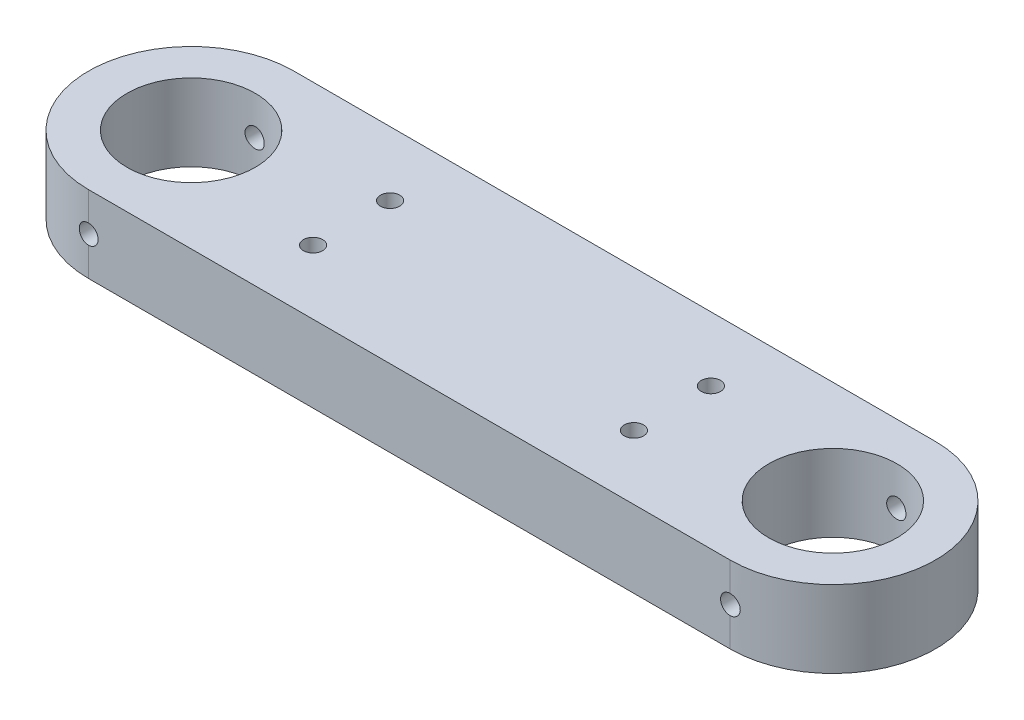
ISO-10303-21;
HEADER;
FILE_DESCRIPTION(('STEP AP214'),'2;1');
FILE_NAME('part.step','',(''),(''),'','','');
FILE_SCHEMA(('AUTOMOTIVE_DESIGN { 1 0 10303 214 1 1 1 1 }'));
ENDSEC;
DATA;
#1=APPLICATION_CONTEXT('core data for automotive mechanical design processes');
#2=APPLICATION_PROTOCOL_DEFINITION('international standard','automotive_design',2000,#1);
#3=PRODUCT_CONTEXT('',#1,'mechanical');
#4=PRODUCT('Part','Part','',(#3));
#5=PRODUCT_RELATED_PRODUCT_CATEGORY('part','',(#4));
#6=PRODUCT_DEFINITION_FORMATION('','',#4);
#7=PRODUCT_DEFINITION_CONTEXT('part definition',#1,'design');
#8=PRODUCT_DEFINITION('design','',#6,#7);
#9=PRODUCT_DEFINITION_SHAPE('','',#8);
#10=(LENGTH_UNIT() NAMED_UNIT(*) SI_UNIT(.MILLI.,.METRE.));
#11=(NAMED_UNIT(*) PLANE_ANGLE_UNIT() SI_UNIT($,.RADIAN.));
#12=(NAMED_UNIT(*) SI_UNIT($,.STERADIAN.) SOLID_ANGLE_UNIT());
#13=UNCERTAINTY_MEASURE_WITH_UNIT(LENGTH_MEASURE(1.E-05),#10,'distance_accuracy_value','');
#14=(GEOMETRIC_REPRESENTATION_CONTEXT(3) GLOBAL_UNCERTAINTY_ASSIGNED_CONTEXT((#13)) GLOBAL_UNIT_ASSIGNED_CONTEXT((#10,
#11,#12)) REPRESENTATION_CONTEXT('',''));
#15=CARTESIAN_POINT('',(0.,0.,0.));
#16=DIRECTION('',(0.,0.,1.));
#17=DIRECTION('',(1.,0.,0.));
#18=AXIS2_PLACEMENT_3D('',#15,#16,#17);
#19=CARTESIAN_POINT('',(-158.75,-38.1,-50.8));
#20=DIRECTION('',(0.,0.,-1.));
#21=DIRECTION('',(-1.,0.,0.));
#22=AXIS2_PLACEMENT_3D('',#19,#20,#21);
#23=PLANE('',#22);
#24=DIRECTION('',(0.,1.,0.));
#25=VECTOR('',#24,1.);
#26=CARTESIAN_POINT('',(158.75,-38.1,-50.8));
#27=LINE('',#26,#25);
#28=CARTESIAN_POINT('',(158.75,-14.2875,-50.8));
#29=VERTEX_POINT('',#28);
#30=CARTESIAN_POINT('',(158.75,0.,-50.8));
#31=VERTEX_POINT('',#30);
#32=EDGE_CURVE('E122',#29,#31,#27,.T.);
#33=ORIENTED_EDGE('',*,*,#32,.F.);
#34=CARTESIAN_POINT('',(158.75,-19.05,-50.8));
#35=DIRECTION('',(0.,0.,-1.));
#36=DIRECTION('',(-1.,0.,0.));
#37=AXIS2_PLACEMENT_3D('',#34,#35,#36);
#38=CIRCLE('',#37,4.76250000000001);
#39=CARTESIAN_POINT('',(158.75,-23.8125,-50.8));
#40=VERTEX_POINT('',#39);
#41=EDGE_CURVE('E53',#29,#40,#38,.F.);
#42=ORIENTED_EDGE('',*,*,#41,.T.);
#43=CARTESIAN_POINT('',(158.75,-38.1,-50.8));
#44=VERTEX_POINT('',#43);
#45=EDGE_CURVE('E124',#44,#40,#27,.T.);
#46=ORIENTED_EDGE('',*,*,#45,.F.);
#47=DIRECTION('',(-1.,0.,0.));
#48=VECTOR('',#47,1.);
#49=CARTESIAN_POINT('',(-158.75,-38.1,-50.8));
#50=LINE('',#49,#48);
#51=CARTESIAN_POINT('',(-158.75,-38.1,-50.8));
#52=VERTEX_POINT('',#51);
#53=EDGE_CURVE('E227',#44,#52,#50,.T.);
#54=ORIENTED_EDGE('',*,*,#53,.T.);
#55=DIRECTION('',(0.,1.,0.));
#56=VECTOR('',#55,1.);
#57=CARTESIAN_POINT('',(-158.75,-38.1,-50.8));
#58=LINE('',#57,#56);
#59=CARTESIAN_POINT('',(-158.75,-23.8125,-50.8));
#60=VERTEX_POINT('',#59);
#61=EDGE_CURVE('E11',#52,#60,#58,.T.);
#62=ORIENTED_EDGE('',*,*,#61,.T.);
#63=CARTESIAN_POINT('',(-158.75,-19.05,-50.8));
#64=DIRECTION('',(0.,0.,-1.));
#65=DIRECTION('',(-1.,0.,0.));
#66=AXIS2_PLACEMENT_3D('',#63,#64,#65);
#67=CIRCLE('',#66,4.76250000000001);
#68=CARTESIAN_POINT('',(-158.75,-14.2875,-50.8));
#69=VERTEX_POINT('',#68);
#70=EDGE_CURVE('E165',#69,#60,#67,.T.);
#71=ORIENTED_EDGE('',*,*,#70,.F.);
#72=CARTESIAN_POINT('',(-158.75,0.,-50.8));
#73=VERTEX_POINT('',#72);
#74=EDGE_CURVE('E46',#69,#73,#58,.T.);
#75=ORIENTED_EDGE('',*,*,#74,.T.);
#76=DIRECTION('',(-1.,0.,0.));
#77=VECTOR('',#76,1.);
#78=CARTESIAN_POINT('',(-158.75,0.,-50.8));
#79=LINE('',#78,#77);
#80=EDGE_CURVE('E218',#31,#73,#79,.T.);
#81=ORIENTED_EDGE('',*,*,#80,.F.);
#82=EDGE_LOOP('',(#33,#42,#46,#54,#62,#71,#75,#81));
#83=FACE_BOUND('',#82,.T.);
#84=ADVANCED_FACE('F32',(#83),#23,.T.);
#85=CARTESIAN_POINT('',(158.75,-38.1,0.));
#86=DIRECTION('',(0.,1.,0.));
#87=DIRECTION('',(0.,0.,1.));
#88=AXIS2_PLACEMENT_3D('',#85,#86,#87);
#89=CYLINDRICAL_SURFACE('',#88,50.8);
#90=ORIENTED_EDGE('',*,*,#45,.T.);
#91=CARTESIAN_POINT('',(158.75,-23.8125,-50.8));
#92=CARTESIAN_POINT('',(158.883635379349,-23.812514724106,-50.8000052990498));
#93=CARTESIAN_POINT('',(159.017268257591,-23.8068759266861,-50.7994728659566));
#94=CARTESIAN_POINT('',(159.283572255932,-23.7843979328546,-50.7973708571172));
#95=CARTESIAN_POINT('',(159.416243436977,-23.7675594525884,-50.7958013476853));
#96=CARTESIAN_POINT('',(159.679568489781,-23.7228084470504,-50.7916653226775));
#97=CARTESIAN_POINT('',(159.810224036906,-23.6949056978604,-50.7890996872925));
#98=CARTESIAN_POINT('',(160.068709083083,-23.6282338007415,-50.7830454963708));
#99=CARTESIAN_POINT('',(160.196538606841,-23.5894647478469,-50.7795569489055));
#100=CARTESIAN_POINT('',(160.448494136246,-23.5013302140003,-50.7717540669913));
#101=CARTESIAN_POINT('',(160.572619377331,-23.4519625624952,-50.7674395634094));
#102=CARTESIAN_POINT('',(160.816309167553,-23.3429704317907,-50.7581051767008));
#103=CARTESIAN_POINT('',(160.935872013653,-23.2833421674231,-50.7530850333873));
#104=CARTESIAN_POINT('',(161.169489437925,-23.1542996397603,-50.742484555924));
#105=CARTESIAN_POINT('',(161.283546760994,-23.0848903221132,-50.7369045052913));
#106=CARTESIAN_POINT('',(161.505460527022,-22.9367273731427,-50.7253367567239));
#107=CARTESIAN_POINT('',(161.613314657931,-22.8579702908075,-50.7193489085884));
#108=CARTESIAN_POINT('',(161.822269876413,-22.6914901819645,-50.7071211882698));
#109=CARTESIAN_POINT('',(161.923354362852,-22.6037463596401,-50.7008807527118));
#110=CARTESIAN_POINT('',(162.117815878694,-22.4200327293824,-50.6883351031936));
#111=CARTESIAN_POINT('',(162.211190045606,-22.3240598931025,-50.6820298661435));
#112=CARTESIAN_POINT('',(162.389512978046,-22.1246125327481,-50.6695365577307));
#113=CARTESIAN_POINT('',(162.474463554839,-22.021139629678,-50.6633484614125));
#114=CARTESIAN_POINT('',(162.635392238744,-21.8073610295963,-50.6512610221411));
#115=CARTESIAN_POINT('',(162.711367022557,-21.6970528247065,-50.6453617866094));
#116=CARTESIAN_POINT('',(162.85387306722,-21.4702469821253,-50.6340137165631));
#117=CARTESIAN_POINT('',(162.920390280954,-21.3537404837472,-50.6285655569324));
#118=CARTESIAN_POINT('',(163.043394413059,-21.1154669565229,-50.6182830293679));
#119=CARTESIAN_POINT('',(163.099877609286,-20.9936979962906,-50.613448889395));
#120=CARTESIAN_POINT('',(163.202352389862,-20.7458585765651,-50.6045373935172));
#121=CARTESIAN_POINT('',(163.248348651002,-20.6197900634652,-50.6004597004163));
#122=CARTESIAN_POINT('',(163.329563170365,-20.3641554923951,-50.5931740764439));
#123=CARTESIAN_POINT('',(163.364777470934,-20.2345881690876,-50.5899664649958));
#124=CARTESIAN_POINT('',(163.424046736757,-19.9733421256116,-50.5845251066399));
#125=CARTESIAN_POINT('',(163.448138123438,-19.8416717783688,-50.5822881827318));
#126=CARTESIAN_POINT('',(163.485172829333,-19.5767627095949,-50.5788340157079));
#127=CARTESIAN_POINT('',(163.498112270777,-19.4435234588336,-50.5776171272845));
#128=CARTESIAN_POINT('',(163.519972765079,-19.0428706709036,-50.5755655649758));
#129=CARTESIAN_POINT('',(163.511999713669,-18.7742404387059,-50.5763239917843));
#130=CARTESIAN_POINT('',(163.466469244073,-18.3760324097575,-50.5805794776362));
#131=CARTESIAN_POINT('',(163.445737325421,-18.2442244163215,-50.5825138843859));
#132=CARTESIAN_POINT('',(163.39330306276,-17.9828234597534,-50.587354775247));
#133=CARTESIAN_POINT('',(163.361604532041,-17.8532297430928,-50.5902609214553));
#134=CARTESIAN_POINT('',(163.287445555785,-17.5971462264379,-50.5969659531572));
#135=CARTESIAN_POINT('',(163.244981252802,-17.4706575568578,-50.6007651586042));
#136=CARTESIAN_POINT('',(163.149621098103,-17.2217517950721,-50.6091456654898));
#137=CARTESIAN_POINT('',(163.096729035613,-17.099333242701,-50.6137266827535));
#138=CARTESIAN_POINT('',(162.980767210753,-16.8591473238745,-50.6235518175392));
#139=CARTESIAN_POINT('',(162.917677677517,-16.7413895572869,-50.6287972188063));
#140=CARTESIAN_POINT('',(162.781869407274,-16.511647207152,-50.6397933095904));
#141=CARTESIAN_POINT('',(162.709154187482,-16.3996605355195,-50.6455438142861));
#142=CARTESIAN_POINT('',(162.554564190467,-16.1821602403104,-50.6573913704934));
#143=CARTESIAN_POINT('',(162.472686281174,-16.0766488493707,-50.6634885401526));
#144=CARTESIAN_POINT('',(162.300398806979,-15.872915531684,-50.6758534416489));
#145=CARTESIAN_POINT('',(162.209992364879,-15.7746909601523,-50.6821211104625));
#146=CARTESIAN_POINT('',(162.020866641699,-15.5857866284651,-50.6946786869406));
#147=CARTESIAN_POINT('',(161.92211468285,-15.4951395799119,-50.7009685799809));
#148=CARTESIAN_POINT('',(161.717354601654,-15.3225158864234,-50.713364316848));
#149=CARTESIAN_POINT('',(161.61134915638,-15.2405360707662,-50.7194702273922));
#150=CARTESIAN_POINT('',(161.392721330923,-15.0857368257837,-50.7313316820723));
#151=CARTESIAN_POINT('',(161.280094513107,-15.0129236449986,-50.7370869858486));
#152=CARTESIAN_POINT('',(161.049126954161,-14.8770675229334,-50.7480775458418));
#153=CARTESIAN_POINT('',(160.930788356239,-14.8140209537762,-50.7533129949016));
#154=CARTESIAN_POINT('',(160.689059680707,-14.6980528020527,-50.7631233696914));
#155=CARTESIAN_POINT('',(160.565664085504,-14.645142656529,-50.767697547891));
#156=CARTESIAN_POINT('',(160.314870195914,-14.5499366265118,-50.7760466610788));
#157=CARTESIAN_POINT('',(160.187473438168,-14.5076367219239,-50.7798218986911));
#158=CARTESIAN_POINT('',(159.929685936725,-14.4339735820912,-50.7864642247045));
#159=CARTESIAN_POINT('',(159.799298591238,-14.4025985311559,-50.7893322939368));
#160=CARTESIAN_POINT('',(159.536377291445,-14.3509626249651,-50.7940831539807));
#161=CARTESIAN_POINT('',(159.403844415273,-14.3306963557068,-50.7959664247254));
#162=CARTESIAN_POINT('',(159.18419753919,-14.3065352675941,-50.7982181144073));
#163=CARTESIAN_POINT('',(159.097430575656,-14.2993926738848,-50.7988860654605));
#164=CARTESIAN_POINT('',(158.923778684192,-14.2898783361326,-50.7997770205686));
#165=CARTESIAN_POINT('',(158.836894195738,-14.287498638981,-50.8000007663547));
#166=CARTESIAN_POINT('',(158.75,-14.2875,-50.8));
#167=B_SPLINE_CURVE_WITH_KNOTS('',3,(#91,#92,#93,#94,#95,#96,#97,#98,#99,#100,#101,#102,#103,
#104,#105,#106,#107,#108,#109,#110,#111,#112,#113,#114,#115,#116,#117,#118,#119,#120,#121,#122,
#123,#124,#125,#126,#127,#128,#129,#130,#131,#132,#133,#134,#135,#136,#137,#138,#139,#140,#141,
#142,#143,#144,#145,#146,#147,#148,#149,#150,#151,#152,#153,#154,#155,#156,#157,#158,#159,#160,
#161,#162,#163,#164,#165,#166),.UNSPECIFIED.,.F.,.F.,(4,2,2,2,2,2,2,2,2,2,2,2,2,2,2,2,2,2,2,2,2,
2,2,2,2,2,2,2,2,2,2,2,2,2,2,2,2,4),(0.,0.400782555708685,0.80153948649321,1.20194310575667,
1.6023432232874,2.00282541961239,2.40345567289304,2.8038840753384,3.20446077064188,
3.6059863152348,4.00766026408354,4.40924765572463,4.81098327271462,5.21330948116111,
5.61578462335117,6.01807992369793,6.42052271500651,6.82163821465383,7.22289313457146,
8.02454691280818,8.42451906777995,8.82435228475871,9.22432896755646,9.62416057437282,
10.0247768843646,10.4252472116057,10.8258548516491,11.2263163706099,11.6284258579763,
12.0303877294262,12.4326221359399,12.834706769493,13.2372424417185,13.6396253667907,
14.0415717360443,14.4433220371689,14.70438879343,14.9650192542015),.UNSPECIFIED.);
#168=EDGE_CURVE('E116',#40,#29,#167,.T.);
#169=ORIENTED_EDGE('',*,*,#168,.T.);
#170=ORIENTED_EDGE('',*,*,#32,.T.);
#171=CARTESIAN_POINT('',(158.75,0.,0.));
#172=DIRECTION('',(0.,1.,0.));
#173=DIRECTION('',(0.,0.,-1.));
#174=AXIS2_PLACEMENT_3D('',#171,#172,#173);
#175=CIRCLE('',#174,50.8);
#176=CARTESIAN_POINT('',(158.75,0.,50.8));
#177=VERTEX_POINT('',#176);
#178=EDGE_CURVE('E215',#177,#31,#175,.T.);
#179=ORIENTED_EDGE('',*,*,#178,.F.);
#180=DIRECTION('',(0.,1.,0.));
#181=VECTOR('',#180,1.);
#182=CARTESIAN_POINT('',(158.75,-38.1,50.8));
#183=LINE('',#182,#181);
#184=CARTESIAN_POINT('',(158.75,-14.2875,50.8));
#185=VERTEX_POINT('',#184);
#186=EDGE_CURVE('E115',#185,#177,#183,.T.);
#187=ORIENTED_EDGE('',*,*,#186,.F.);
#188=CARTESIAN_POINT('',(158.75,-14.2875,50.8));
#189=CARTESIAN_POINT('',(158.883635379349,-14.287485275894,50.8000052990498));
#190=CARTESIAN_POINT('',(159.017268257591,-14.2931240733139,50.7994728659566));
#191=CARTESIAN_POINT('',(159.283572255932,-14.3156020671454,50.7973708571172));
#192=CARTESIAN_POINT('',(159.416243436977,-14.3324405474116,50.7958013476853));
#193=CARTESIAN_POINT('',(159.679568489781,-14.3771915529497,50.7916653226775));
#194=CARTESIAN_POINT('',(159.810224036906,-14.4050943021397,50.7890996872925));
#195=CARTESIAN_POINT('',(160.068709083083,-14.4717661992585,50.7830454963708));
#196=CARTESIAN_POINT('',(160.196538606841,-14.5105352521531,50.7795569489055));
#197=CARTESIAN_POINT('',(160.448494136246,-14.5986697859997,50.7717540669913));
#198=CARTESIAN_POINT('',(160.572619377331,-14.6480374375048,50.7674395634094));
#199=CARTESIAN_POINT('',(160.816309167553,-14.7570295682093,50.7581051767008));
#200=CARTESIAN_POINT('',(160.935872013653,-14.8166578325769,50.7530850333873));
#201=CARTESIAN_POINT('',(161.169489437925,-14.9457003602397,50.742484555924));
#202=CARTESIAN_POINT('',(161.283546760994,-15.0151096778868,50.7369045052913));
#203=CARTESIAN_POINT('',(161.505460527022,-15.1632726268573,50.7253367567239));
#204=CARTESIAN_POINT('',(161.613314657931,-15.2420297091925,50.7193489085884));
#205=CARTESIAN_POINT('',(161.822269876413,-15.4085098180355,50.7071211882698));
#206=CARTESIAN_POINT('',(161.923354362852,-15.4962536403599,50.7008807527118));
#207=CARTESIAN_POINT('',(162.117815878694,-15.6799672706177,50.6883351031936));
#208=CARTESIAN_POINT('',(162.211190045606,-15.7759401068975,50.6820298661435));
#209=CARTESIAN_POINT('',(162.389512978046,-15.9753874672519,50.6695365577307));
#210=CARTESIAN_POINT('',(162.474463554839,-16.078860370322,50.6633484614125));
#211=CARTESIAN_POINT('',(162.635392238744,-16.2926389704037,50.6512610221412));
#212=CARTESIAN_POINT('',(162.711367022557,-16.4029471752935,50.6453617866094));
#213=CARTESIAN_POINT('',(162.85387306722,-16.6297530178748,50.6340137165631));
#214=CARTESIAN_POINT('',(162.920390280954,-16.7462595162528,50.6285655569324));
#215=CARTESIAN_POINT('',(163.043394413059,-16.9845330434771,50.6182830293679));
#216=CARTESIAN_POINT('',(163.099877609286,-17.1063020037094,50.613448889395));
#217=CARTESIAN_POINT('',(163.202352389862,-17.3541414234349,50.6045373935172));
#218=CARTESIAN_POINT('',(163.248348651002,-17.4802099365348,50.6004597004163));
#219=CARTESIAN_POINT('',(163.329563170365,-17.7358445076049,50.5931740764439));
#220=CARTESIAN_POINT('',(163.364777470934,-17.8654118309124,50.5899664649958));
#221=CARTESIAN_POINT('',(163.424046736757,-18.1266578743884,50.5845251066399));
#222=CARTESIAN_POINT('',(163.448138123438,-18.2583282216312,50.5822881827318));
#223=CARTESIAN_POINT('',(163.485172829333,-18.5232372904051,50.5788340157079));
#224=CARTESIAN_POINT('',(163.498112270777,-18.6564765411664,50.5776171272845));
#225=CARTESIAN_POINT('',(163.519972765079,-19.0571293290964,50.5755655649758));
#226=CARTESIAN_POINT('',(163.511999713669,-19.3257595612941,50.5763239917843));
#227=CARTESIAN_POINT('',(163.466469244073,-19.7239675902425,50.5805794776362));
#228=CARTESIAN_POINT('',(163.445737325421,-19.8557755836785,50.5825138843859));
#229=CARTESIAN_POINT('',(163.39330306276,-20.1171765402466,50.587354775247));
#230=CARTESIAN_POINT('',(163.361604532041,-20.2467702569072,50.5902609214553));
#231=CARTESIAN_POINT('',(163.287445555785,-20.5028537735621,50.5969659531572));
#232=CARTESIAN_POINT('',(163.244981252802,-20.6293424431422,50.6007651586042));
#233=CARTESIAN_POINT('',(163.149621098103,-20.8782482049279,50.6091456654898));
#234=CARTESIAN_POINT('',(163.096729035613,-21.0006667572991,50.6137266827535));
#235=CARTESIAN_POINT('',(162.980767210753,-21.2408526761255,50.6235518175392));
#236=CARTESIAN_POINT('',(162.917677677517,-21.3586104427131,50.6287972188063));
#237=CARTESIAN_POINT('',(162.781869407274,-21.588352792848,50.6397933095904));
#238=CARTESIAN_POINT('',(162.709154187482,-21.7003394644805,50.6455438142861));
#239=CARTESIAN_POINT('',(162.554564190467,-21.9178397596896,50.6573913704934));
#240=CARTESIAN_POINT('',(162.472686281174,-22.0233511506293,50.6634885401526));
#241=CARTESIAN_POINT('',(162.300398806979,-22.2270844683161,50.6758534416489));
#242=CARTESIAN_POINT('',(162.209992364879,-22.3253090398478,50.6821211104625));
#243=CARTESIAN_POINT('',(162.020866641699,-22.5142133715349,50.6946786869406));
#244=CARTESIAN_POINT('',(161.92211468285,-22.6048604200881,50.7009685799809));
#245=CARTESIAN_POINT('',(161.717354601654,-22.7774841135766,50.713364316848));
#246=CARTESIAN_POINT('',(161.61134915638,-22.8594639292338,50.7194702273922));
#247=CARTESIAN_POINT('',(161.392721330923,-23.0142631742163,50.7313316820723));
#248=CARTESIAN_POINT('',(161.280094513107,-23.0870763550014,50.7370869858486));
#249=CARTESIAN_POINT('',(161.049126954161,-23.2229324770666,50.7480775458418));
#250=CARTESIAN_POINT('',(160.930788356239,-23.2859790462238,50.7533129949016));
#251=CARTESIAN_POINT('',(160.689059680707,-23.4019471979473,50.7631233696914));
#252=CARTESIAN_POINT('',(160.565664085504,-23.454857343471,50.767697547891));
#253=CARTESIAN_POINT('',(160.314870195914,-23.5500633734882,50.7760466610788));
#254=CARTESIAN_POINT('',(160.187473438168,-23.5923632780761,50.7798218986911));
#255=CARTESIAN_POINT('',(159.929685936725,-23.6660264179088,50.7864642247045));
#256=CARTESIAN_POINT('',(159.799298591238,-23.6974014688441,50.7893322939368));
#257=CARTESIAN_POINT('',(159.536377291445,-23.7490373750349,50.7940831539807));
#258=CARTESIAN_POINT('',(159.403844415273,-23.7693036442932,50.7959664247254));
#259=CARTESIAN_POINT('',(159.18419753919,-23.7934647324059,50.7982181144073));
#260=CARTESIAN_POINT('',(159.097430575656,-23.8006073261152,50.7988860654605));
#261=CARTESIAN_POINT('',(158.923778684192,-23.8101216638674,50.7997770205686));
#262=CARTESIAN_POINT('',(158.836894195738,-23.812501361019,50.8000007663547));
#263=CARTESIAN_POINT('',(158.75,-23.8125,50.8));
#264=B_SPLINE_CURVE_WITH_KNOTS('',3,(#188,#189,#190,#191,#192,#193,#194,#195,#196,#197,#198,
#199,#200,#201,#202,#203,#204,#205,#206,#207,#208,#209,#210,#211,#212,#213,#214,#215,#216,#217,
#218,#219,#220,#221,#222,#223,#224,#225,#226,#227,#228,#229,#230,#231,#232,#233,#234,#235,#236,
#237,#238,#239,#240,#241,#242,#243,#244,#245,#246,#247,#248,#249,#250,#251,#252,#253,#254,#255,
#256,#257,#258,#259,#260,#261,#262,#263),.UNSPECIFIED.,.F.,.F.,(4,2,2,2,2,2,2,2,2,2,2,2,2,2,2,2,
2,2,2,2,2,2,2,2,2,2,2,2,2,2,2,2,2,2,2,2,2,4),(0.,0.400782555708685,0.80153948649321,
1.20194310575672,1.6023432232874,2.00282541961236,2.40345567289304,2.8038840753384,
3.20446077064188,3.6059863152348,4.00766026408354,4.40924765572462,4.81098327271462,
5.21330948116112,5.61578462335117,6.01807992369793,6.42052271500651,6.82163821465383,
7.22289313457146,8.02454691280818,8.42451906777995,8.82435228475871,9.22432896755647,
9.62416057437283,10.0247768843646,10.4252472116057,10.8258548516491,11.2263163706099,
11.6284258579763,12.0303877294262,12.4326221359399,12.834706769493,13.2372424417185,
13.6396253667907,14.0415717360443,14.4433220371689,14.70438879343,14.9650192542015),.UNSPECIFIED.);
#265=CARTESIAN_POINT('',(158.75,-23.8125,50.8));
#266=VERTEX_POINT('',#265);
#267=EDGE_CURVE('E60',#185,#266,#264,.T.);
#268=ORIENTED_EDGE('',*,*,#267,.T.);
#269=CARTESIAN_POINT('',(158.75,-38.1,50.8));
#270=VERTEX_POINT('',#269);
#271=EDGE_CURVE('E112',#270,#266,#183,.T.);
#272=ORIENTED_EDGE('',*,*,#271,.F.);
#273=CARTESIAN_POINT('',(158.75,-38.1,0.));
#274=DIRECTION('',(0.,1.,0.));
#275=DIRECTION('',(0.,0.,-1.));
#276=AXIS2_PLACEMENT_3D('',#273,#274,#275);
#277=CIRCLE('',#276,50.8);
#278=EDGE_CURVE('E225',#270,#44,#277,.T.);
#279=ORIENTED_EDGE('',*,*,#278,.T.);
#280=EDGE_LOOP('',(#90,#169,#170,#179,#187,#268,#272,#279));
#281=FACE_BOUND('',#280,.T.);
#282=ADVANCED_FACE('F110',(#281),#89,.T.);
#283=CARTESIAN_POINT('',(-158.75,-38.1,50.8));
#284=DIRECTION('',(0.,0.,1.));
#285=DIRECTION('',(1.,0.,0.));
#286=AXIS2_PLACEMENT_3D('',#283,#284,#285);
#287=PLANE('',#286);
#288=ORIENTED_EDGE('',*,*,#271,.T.);
#289=CARTESIAN_POINT('',(158.75,-19.05,50.8));
#290=DIRECTION('',(0.,0.,1.));
#291=DIRECTION('',(1.,0.,0.));
#292=AXIS2_PLACEMENT_3D('',#289,#290,#291);
#293=CIRCLE('',#292,4.76250000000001);
#294=EDGE_CURVE('E101',#266,#185,#293,.F.);
#295=ORIENTED_EDGE('',*,*,#294,.T.);
#296=ORIENTED_EDGE('',*,*,#186,.T.);
#297=DIRECTION('',(1.,0.,0.));
#298=VECTOR('',#297,1.);
#299=CARTESIAN_POINT('',(-158.75,0.,50.8));
#300=LINE('',#299,#298);
#301=CARTESIAN_POINT('',(-158.75,0.,50.8));
#302=VERTEX_POINT('',#301);
#303=EDGE_CURVE('E212',#302,#177,#300,.T.);
#304=ORIENTED_EDGE('',*,*,#303,.F.);
#305=DIRECTION('',(0.,1.,0.));
#306=VECTOR('',#305,1.);
#307=CARTESIAN_POINT('',(-158.75,-38.1,50.8));
#308=LINE('',#307,#306);
#309=CARTESIAN_POINT('',(-158.75,-14.2875,50.8));
#310=VERTEX_POINT('',#309);
#311=EDGE_CURVE('E130',#310,#302,#308,.T.);
#312=ORIENTED_EDGE('',*,*,#311,.F.);
#313=CARTESIAN_POINT('',(-158.75,-19.05,50.8));
#314=DIRECTION('',(0.,0.,1.));
#315=DIRECTION('',(1.,0.,0.));
#316=AXIS2_PLACEMENT_3D('',#313,#314,#315);
#317=CIRCLE('',#316,4.76250000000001);
#318=CARTESIAN_POINT('',(-158.75,-23.8125,50.8));
#319=VERTEX_POINT('',#318);
#320=EDGE_CURVE('E166',#319,#310,#317,.T.);
#321=ORIENTED_EDGE('',*,*,#320,.F.);
#322=CARTESIAN_POINT('',(-158.75,-38.1,50.8));
#323=VERTEX_POINT('',#322);
#324=EDGE_CURVE('E126',#323,#319,#308,.T.);
#325=ORIENTED_EDGE('',*,*,#324,.F.);
#326=DIRECTION('',(1.,0.,0.));
#327=VECTOR('',#326,1.);
#328=CARTESIAN_POINT('',(-158.75,-38.1,50.8));
#329=LINE('',#328,#327);
#330=EDGE_CURVE('E121',#323,#270,#329,.T.);
#331=ORIENTED_EDGE('',*,*,#330,.T.);
#332=EDGE_LOOP('',(#288,#295,#296,#304,#312,#321,#325,#331));
#333=FACE_BOUND('',#332,.T.);
#334=ADVANCED_FACE('F119',(#333),#287,.T.);
#335=CARTESIAN_POINT('',(158.75,-38.1,0.));
#336=DIRECTION('',(0.,1.,0.));
#337=DIRECTION('',(0.,0.,1.));
#338=AXIS2_PLACEMENT_3D('',#335,#336,#337);
#339=CYLINDRICAL_SURFACE('',#338,31.75);
#340=CARTESIAN_POINT('',(163.5125,-19.05,-31.3907803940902));
#341=CARTESIAN_POINT('',(163.512489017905,-18.7841078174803,-31.3907848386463));
#342=CARTESIAN_POINT('',(163.490157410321,-18.518061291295,-31.3941952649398));
#343=CARTESIAN_POINT('',(163.401444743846,-17.99340662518,-31.40745924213));
#344=CARTESIAN_POINT('',(163.335020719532,-17.7348059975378,-31.4173190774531));
#345=CARTESIAN_POINT('',(163.160155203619,-17.2327133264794,-31.4423405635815));
#346=CARTESIAN_POINT('',(163.051745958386,-16.9892098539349,-31.4574981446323));
#347=CARTESIAN_POINT('',(162.796063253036,-16.5238841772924,-31.4914024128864));
#348=CARTESIAN_POINT('',(162.648795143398,-16.3020589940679,-31.5101486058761));
#349=CARTESIAN_POINT('',(162.31831590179,-15.8845763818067,-31.549285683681));
#350=CARTESIAN_POINT('',(162.134854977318,-15.689117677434,-31.5696873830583));
#351=CARTESIAN_POINT('',(161.737737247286,-15.3316384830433,-31.6097401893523));
#352=CARTESIAN_POINT('',(161.524078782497,-15.1696198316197,-31.6293912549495));
#353=CARTESIAN_POINT('',(161.071357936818,-14.88288669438,-31.6658417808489));
#354=CARTESIAN_POINT('',(160.832178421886,-14.7583551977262,-31.6826270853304));
#355=CARTESIAN_POINT('',(160.33600409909,-14.551305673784,-31.7113350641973));
#356=CARTESIAN_POINT('',(160.079010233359,-14.4687854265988,-31.7232579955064));
#357=CARTESIAN_POINT('',(159.556548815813,-14.3487032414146,-31.7408215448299));
#358=CARTESIAN_POINT('',(159.291159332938,-14.3108085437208,-31.7465086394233));
#359=CARTESIAN_POINT('',(158.757731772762,-14.280019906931,-31.7511190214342));
#360=CARTESIAN_POINT('',(158.489693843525,-14.28712346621,-31.7500426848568));
#361=CARTESIAN_POINT('',(157.960848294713,-14.3458670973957,-31.7412846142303));
#362=CARTESIAN_POINT('',(157.699999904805,-14.397149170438,-31.7336559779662));
#363=CARTESIAN_POINT('',(157.190653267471,-14.5422321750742,-31.7127096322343));
#364=CARTESIAN_POINT('',(156.942155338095,-14.6360342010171,-31.6993917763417));
#365=CARTESIAN_POINT('',(156.463479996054,-14.8638609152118,-31.6684721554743));
#366=CARTESIAN_POINT('',(156.233375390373,-14.9980363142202,-31.6508543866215));
#367=CARTESIAN_POINT('',(155.798812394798,-15.3026909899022,-31.6132984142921));
#368=CARTESIAN_POINT('',(155.594355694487,-15.4731726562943,-31.5933600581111));
#369=CARTESIAN_POINT('',(155.214782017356,-15.8475948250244,-31.5531550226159));
#370=CARTESIAN_POINT('',(155.039973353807,-16.0518478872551,-31.5328870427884));
#371=CARTESIAN_POINT('',(154.727065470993,-16.4869529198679,-31.4944983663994));
#372=CARTESIAN_POINT('',(154.588966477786,-16.7178050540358,-31.4763776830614));
#373=CARTESIAN_POINT('',(154.353356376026,-17.1998765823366,-31.4443356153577));
#374=CARTESIAN_POINT('',(154.255876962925,-17.4511116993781,-31.430417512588));
#375=CARTESIAN_POINT('',(154.104583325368,-17.966643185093,-31.4084145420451));
#376=CARTESIAN_POINT('',(154.05076602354,-18.230938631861,-31.40032926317));
#377=CARTESIAN_POINT('',(153.988747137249,-18.7623452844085,-31.3909853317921));
#378=CARTESIAN_POINT('',(153.980108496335,-19.0294043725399,-31.3896612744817));
#379=CARTESIAN_POINT('',(154.007532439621,-19.5611565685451,-31.3938160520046));
#380=CARTESIAN_POINT('',(154.043593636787,-19.8258497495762,-31.399294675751));
#381=CARTESIAN_POINT('',(154.15902293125,-20.3440024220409,-31.4163774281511));
#382=CARTESIAN_POINT('',(154.238173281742,-20.5975115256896,-31.4279507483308));
#383=CARTESIAN_POINT('',(154.43730758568,-21.0876644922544,-31.4558934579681));
#384=CARTESIAN_POINT('',(154.557293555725,-21.3243075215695,-31.4722630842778));
#385=CARTESIAN_POINT('',(154.835743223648,-21.7759701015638,-31.5081080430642));
#386=CARTESIAN_POINT('',(154.994489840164,-21.9908134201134,-31.5276058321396));
#387=CARTESIAN_POINT('',(155.345561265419,-22.3909663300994,-31.567442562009));
#388=CARTESIAN_POINT('',(155.537887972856,-22.5762742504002,-31.5877815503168));
#389=CARTESIAN_POINT('',(155.952584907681,-22.9136657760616,-31.627213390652));
#390=CARTESIAN_POINT('',(156.175192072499,-23.0654597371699,-31.6462944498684));
#391=CARTESIAN_POINT('',(156.642999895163,-23.3294964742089,-31.6808772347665));
#392=CARTESIAN_POINT('',(156.888199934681,-23.4417403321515,-31.6963790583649));
#393=CARTESIAN_POINT('',(157.393328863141,-23.6230278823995,-31.7220050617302));
#394=CARTESIAN_POINT('',(157.653199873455,-23.6922299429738,-31.7321489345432));
#395=CARTESIAN_POINT('',(158.181037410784,-23.7859820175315,-31.7459987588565));
#396=CARTESIAN_POINT('',(158.449003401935,-23.810534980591,-31.7497051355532));
#397=CARTESIAN_POINT('',(158.982615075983,-23.8142199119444,-31.7502580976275));
#398=CARTESIAN_POINT('',(159.248257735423,-23.7937950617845,-31.7471716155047));
#399=CARTESIAN_POINT('',(159.772285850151,-23.7090540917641,-31.7346206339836));
#400=CARTESIAN_POINT('',(160.030671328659,-23.6447381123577,-31.7251561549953));
#401=CARTESIAN_POINT('',(160.532728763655,-23.4741977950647,-31.70090772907));
#402=CARTESIAN_POINT('',(160.776411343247,-23.3680041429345,-31.6861276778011));
#403=CARTESIAN_POINT('',(161.242569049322,-23.1167702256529,-31.6528714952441));
#404=CARTESIAN_POINT('',(161.465043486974,-22.9717286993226,-31.6343952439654));
#405=CARTESIAN_POINT('',(161.884717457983,-22.6453138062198,-31.5955842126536));
#406=CARTESIAN_POINT('',(162.081661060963,-22.463613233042,-31.5752336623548));
#407=CARTESIAN_POINT('',(162.442423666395,-22.0697263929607,-31.5350843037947));
#408=CARTESIAN_POINT('',(162.606234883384,-21.8575329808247,-31.5152856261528));
#409=CARTESIAN_POINT('',(162.896909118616,-21.4072819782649,-31.4783623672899));
#410=CARTESIAN_POINT('',(163.02355934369,-21.1690857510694,-31.4612534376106));
#411=CARTESIAN_POINT('',(163.234865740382,-20.6746577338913,-31.4318303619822));
#412=CARTESIAN_POINT('',(163.31956549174,-20.4184449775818,-31.4195112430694));
#413=CARTESIAN_POINT('',(163.425344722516,-19.9759016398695,-31.4039086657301));
#414=CARTESIAN_POINT('',(163.45797794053,-19.7923042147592,-31.3990116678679));
#415=CARTESIAN_POINT('',(163.501559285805,-19.4224964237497,-31.3924459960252));
#416=CARTESIAN_POINT('',(163.51250769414,-19.2362860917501,-31.3907772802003));
#417=CARTESIAN_POINT('',(163.5125,-19.05,-31.3907803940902));
#418=B_SPLINE_CURVE_WITH_KNOTS('',3,(#340,#341,#342,#343,#344,#345,#346,#347,#348,#349,#350,
#351,#352,#353,#354,#355,#356,#357,#358,#359,#360,#361,#362,#363,#364,#365,#366,#367,#368,#369,
#370,#371,#372,#373,#374,#375,#376,#377,#378,#379,#380,#381,#382,#383,#384,#385,#386,#387,#388,
#389,#390,#391,#392,#393,#394,#395,#396,#397,#398,#399,#400,#401,#402,#403,#404,#405,#406,#407,
#408,#409,#410,#411,#412,#413,#414,#415,#416,#417),.UNSPECIFIED.,.T.,.F.,(4,2,2,2,2,2,2,2,2,2,2,
2,2,2,2,2,2,2,2,2,2,2,2,2,2,2,2,2,2,2,2,2,2,2,2,2,2,2,4),(0.,0.796995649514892,1.59476906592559,
2.39193097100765,3.18898317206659,3.99174203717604,4.79454502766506,5.60120552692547,
6.40782339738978,7.20838768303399,8.00890746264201,8.80300063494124,9.59711424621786,
10.3942297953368,11.1913978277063,11.9964055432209,12.8014182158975,13.607057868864,
14.4126407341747,15.2104158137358,16.0081661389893,16.801922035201,17.5957171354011,
18.3954891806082,19.1953064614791,20.001786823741,20.8082451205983,21.611718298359,
22.4151384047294,23.2106775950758,24.0062142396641,24.8011690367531,25.5961496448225,
26.3985676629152,27.2011740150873,28.0082904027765,28.8145665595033,29.3729550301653,
29.9313362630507),.UNSPECIFIED.);
#419=CARTESIAN_POINT('',(163.5125,-19.05,-31.3907803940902));
#420=VERTEX_POINT('',#419);
#421=EDGE_CURVE('E410',#420,#420,#418,.T.);
#422=ORIENTED_EDGE('',*,*,#421,.F.);
#423=EDGE_LOOP('',(#422));
#424=FACE_BOUND('',#423,.T.);
#425=CARTESIAN_POINT('',(158.75,-38.1,0.));
#426=DIRECTION('',(0.,1.,0.));
#427=DIRECTION('',(0.,0.,1.));
#428=AXIS2_PLACEMENT_3D('',#425,#426,#427);
#429=CIRCLE('',#428,31.75);
#430=CARTESIAN_POINT('',(158.75,-38.1,31.75));
#431=VERTEX_POINT('',#430);
#432=EDGE_CURVE('E200',#431,#431,#429,.T.);
#433=ORIENTED_EDGE('',*,*,#432,.F.);
#434=EDGE_LOOP('',(#433));
#435=FACE_BOUND('',#434,.T.);
#436=CARTESIAN_POINT('',(158.75,0.,0.));
#437=DIRECTION('',(0.,1.,0.));
#438=DIRECTION('',(0.,0.,1.));
#439=AXIS2_PLACEMENT_3D('',#436,#437,#438);
#440=CIRCLE('',#439,31.75);
#441=CARTESIAN_POINT('',(158.75,0.,31.75));
#442=VERTEX_POINT('',#441);
#443=EDGE_CURVE('E197',#442,#442,#440,.T.);
#444=ORIENTED_EDGE('',*,*,#443,.T.);
#445=EDGE_LOOP('',(#444));
#446=FACE_BOUND('',#445,.T.);
#447=CARTESIAN_POINT('',(158.75,-23.8125,31.75));
#448=CARTESIAN_POINT('',(158.484088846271,-23.8124890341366,31.7499957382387));
#449=CARTESIAN_POINT('',(158.218023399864,-23.790154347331,31.746624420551));
#450=CARTESIAN_POINT('',(157.693329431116,-23.7014283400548,31.7335000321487));
#451=CARTESIAN_POINT('',(157.434708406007,-23.63499412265,31.7237407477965));
#452=CARTESIAN_POINT('',(156.932572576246,-23.4600987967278,31.6989371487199));
#453=CARTESIAN_POINT('',(156.68904651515,-23.3516694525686,31.6838968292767));
#454=CARTESIAN_POINT('',(156.223682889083,-23.0959393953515,31.6501931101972));
#455=CARTESIAN_POINT('',(156.001842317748,-22.9486440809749,31.6315302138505));
#456=CARTESIAN_POINT('',(155.58437666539,-22.6181371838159,31.5924936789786));
#457=CARTESIAN_POINT('',(155.388945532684,-22.434681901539,31.572109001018));
#458=CARTESIAN_POINT('',(155.031519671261,-22.037587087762,31.5320127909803));
#459=CARTESIAN_POINT('',(154.869526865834,-21.8239458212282,31.5123012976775));
#460=CARTESIAN_POINT('',(154.582821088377,-21.3712404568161,31.4756761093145));
#461=CARTESIAN_POINT('',(154.458295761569,-21.1320562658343,31.4587766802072));
#462=CARTESIAN_POINT('',(154.251258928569,-20.6358717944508,31.429839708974));
#463=CARTESIAN_POINT('',(154.168745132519,-20.3788724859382,31.4178019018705));
#464=CARTESIAN_POINT('',(154.048675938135,-19.8563927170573,31.4000596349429));
#465=CARTESIAN_POINT('',(154.010788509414,-19.5909901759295,31.3943084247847));
#466=CARTESIAN_POINT('',(153.980018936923,-19.0575369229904,31.389648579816));
#467=CARTESIAN_POINT('',(153.987134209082,-18.7894863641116,31.3907395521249));
#468=CARTESIAN_POINT('',(154.045896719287,-18.2606915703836,31.399598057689));
#469=CARTESIAN_POINT('',(154.097174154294,-17.9999051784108,31.4073101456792));
#470=CARTESIAN_POINT('',(154.242226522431,-17.4906801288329,31.4284553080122));
#471=CARTESIAN_POINT('',(154.336002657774,-17.2422418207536,31.4418885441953));
#472=CARTESIAN_POINT('',(154.563775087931,-16.7636400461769,31.473023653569));
#473=CARTESIAN_POINT('',(154.697928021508,-16.5335522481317,31.4907420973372));
#474=CARTESIAN_POINT('',(155.002534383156,-16.0990134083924,31.5284392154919));
#475=CARTESIAN_POINT('',(155.172990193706,-15.8945640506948,31.5484180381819));
#476=CARTESIAN_POINT('',(155.547393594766,-15.5149624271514,31.5886297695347));
#477=CARTESIAN_POINT('',(155.751659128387,-15.3401236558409,31.6088632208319));
#478=CARTESIAN_POINT('',(156.186799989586,-15.0271609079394,31.6471188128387));
#479=CARTESIAN_POINT('',(156.417675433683,-14.8890370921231,31.6651409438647));
#480=CARTESIAN_POINT('',(156.899754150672,-14.6534089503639,31.6969621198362));
#481=CARTESIAN_POINT('',(157.150969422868,-14.5559288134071,31.7107586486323));
#482=CARTESIAN_POINT('',(157.666457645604,-14.4046276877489,31.7325530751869));
#483=CARTESIAN_POINT('',(157.930729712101,-14.3508037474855,31.7405513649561));
#484=CARTESIAN_POINT('',(158.462124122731,-14.288759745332,31.7497962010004));
#485=CARTESIAN_POINT('',(158.729195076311,-14.2801086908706,31.7511065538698));
#486=CARTESIAN_POINT('',(159.260973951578,-14.3075120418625,31.7470015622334));
#487=CARTESIAN_POINT('',(159.525681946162,-14.3435650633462,31.7415864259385));
#488=CARTESIAN_POINT('',(160.043915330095,-14.4589947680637,31.7246783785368));
#489=CARTESIAN_POINT('',(160.297488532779,-14.5381614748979,31.7132149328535));
#490=CARTESIAN_POINT('',(160.787762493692,-14.7373498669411,31.6854914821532));
#491=CARTESIAN_POINT('',(161.024462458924,-14.8573734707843,31.6692312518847));
#492=CARTESIAN_POINT('',(161.476166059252,-15.1358797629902,31.6335626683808));
#493=CARTESIAN_POINT('',(161.690999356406,-15.2946358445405,31.6141322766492));
#494=CARTESIAN_POINT('',(162.091127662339,-15.6457199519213,31.5743546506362));
#495=CARTESIAN_POINT('',(162.276420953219,-15.8380499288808,31.554007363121));
#496=CARTESIAN_POINT('',(162.613777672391,-16.2527409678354,31.5144868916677));
#497=CARTESIAN_POINT('',(162.765552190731,-16.4753382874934,31.4953248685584));
#498=CARTESIAN_POINT('',(163.029554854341,-16.9431209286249,31.4605422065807));
#499=CARTESIAN_POINT('',(163.141784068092,-17.1883056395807,31.4449214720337));
#500=CARTESIAN_POINT('',(163.323062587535,-17.6934416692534,31.4190707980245));
#501=CARTESIAN_POINT('',(163.392263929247,-17.9533374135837,31.4088218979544));
#502=CARTESIAN_POINT('',(163.486006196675,-18.4812273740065,31.3948248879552));
#503=CARTESIAN_POINT('',(163.510550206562,-18.7492210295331,31.3910763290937));
#504=CARTESIAN_POINT('',(163.514207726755,-19.2828197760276,31.3905211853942));
#505=CARTESIAN_POINT('',(163.493775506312,-19.5484217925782,31.3936451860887));
#506=CARTESIAN_POINT('',(163.409034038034,-20.0723667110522,31.4063323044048));
#507=CARTESIAN_POINT('',(163.344724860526,-20.33070962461,31.4158954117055));
#508=CARTESIAN_POINT('',(163.174215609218,-20.832677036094,31.4403589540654));
#509=CARTESIAN_POINT('',(163.068047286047,-21.0763125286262,31.4552553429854));
#510=CARTESIAN_POINT('',(162.816878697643,-21.5423865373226,31.488711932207));
#511=CARTESIAN_POINT('',(162.671877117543,-21.7648243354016,31.5072722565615));
#512=CARTESIAN_POINT('',(162.345507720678,-22.1844967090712,31.5461886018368));
#513=CARTESIAN_POINT('',(162.163803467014,-22.3814682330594,31.5665601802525));
#514=CARTESIAN_POINT('',(161.769897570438,-22.7422854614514,31.6066737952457));
#515=CARTESIAN_POINT('',(161.557688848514,-22.9061234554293,31.6264156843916));
#516=CARTESIAN_POINT('',(161.107423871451,-23.1968283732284,31.663169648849));
#517=CARTESIAN_POINT('',(160.869231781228,-23.3234868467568,31.68016610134));
#518=CARTESIAN_POINT('',(160.37481218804,-23.5348097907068,31.709360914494));
#519=CARTESIAN_POINT('',(160.118603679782,-23.6195177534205,31.7215642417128));
#520=CARTESIAN_POINT('',(159.676038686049,-23.7253187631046,31.7370123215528));
#521=CARTESIAN_POINT('',(159.492413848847,-23.7579617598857,31.7418576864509));
#522=CARTESIAN_POINT('',(159.12255123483,-23.8015560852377,31.7483529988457));
#523=CARTESIAN_POINT('',(158.936313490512,-23.8125076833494,31.7500029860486));
#524=CARTESIAN_POINT('',(158.75,-23.8125,31.75));
#525=B_SPLINE_CURVE_WITH_KNOTS('',3,(#447,#448,#449,#450,#451,#452,#453,#454,#455,#456,#457,
#458,#459,#460,#461,#462,#463,#464,#465,#466,#467,#468,#469,#470,#471,#472,#473,#474,#475,#476,
#477,#478,#479,#480,#481,#482,#483,#484,#485,#486,#487,#488,#489,#490,#491,#492,#493,#494,#495,
#496,#497,#498,#499,#500,#501,#502,#503,#504,#505,#506,#507,#508,#509,#510,#511,#512,#513,#514,
#515,#516,#517,#518,#519,#520,#521,#522,#523,#524),.UNSPECIFIED.,.T.,.F.,(4,2,2,2,2,2,2,2,2,2,2,
2,2,2,2,2,2,2,2,2,2,2,2,2,2,2,2,2,2,2,2,2,2,2,2,2,2,2,4),(0.,0.797052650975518,1.59488175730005,
2.39210857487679,3.18922471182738,3.99190896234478,4.79463936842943,5.60132555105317,
6.40796776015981,7.2085696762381,8.00912562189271,8.80304237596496,9.59698158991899,
10.3940414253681,11.191153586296,11.9962387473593,12.8013274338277,13.6068945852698,
14.4124072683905,15.2102203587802,16.0080087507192,16.8019459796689,17.5959204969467,
18.3956702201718,19.195466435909,20.0019083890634,20.8083285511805,21.6118828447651,
22.4153816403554,23.2108022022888,24.0062214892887,24.8010385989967,25.5958826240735,
26.3983733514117,27.2010506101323,28.0081457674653,28.8144024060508,29.3728728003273,
29.9313362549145),.UNSPECIFIED.);
#526=CARTESIAN_POINT('',(158.75,-23.8125,31.75));
#527=VERTEX_POINT('',#526);
#528=EDGE_CURVE('E37',#527,#527,#525,.T.);
#529=ORIENTED_EDGE('',*,*,#528,.F.);
#530=EDGE_LOOP('',(#529));
#531=FACE_BOUND('',#530,.T.);
#532=ADVANCED_FACE('F258',(#424,#435,#446,#531),#339,.F.);
#533=CARTESIAN_POINT('',(-158.75,-38.1,0.));
#534=DIRECTION('',(0.,1.,0.));
#535=DIRECTION('',(0.,0.,1.));
#536=AXIS2_PLACEMENT_3D('',#533,#534,#535);
#537=CYLINDRICAL_SURFACE('',#536,50.8);
#538=CARTESIAN_POINT('',(-158.75,-14.2875,50.8));
#539=CARTESIAN_POINT('',(-158.883635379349,-14.287485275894,50.8000052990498));
#540=CARTESIAN_POINT('',(-159.017268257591,-14.2931240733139,50.7994728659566));
#541=CARTESIAN_POINT('',(-159.283572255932,-14.3156020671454,50.7973708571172));
#542=CARTESIAN_POINT('',(-159.416243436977,-14.3324405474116,50.7958013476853));
#543=CARTESIAN_POINT('',(-159.679568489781,-14.3771915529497,50.7916653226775));
#544=CARTESIAN_POINT('',(-159.810224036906,-14.4050943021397,50.7890996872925));
#545=CARTESIAN_POINT('',(-160.068709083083,-14.4717661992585,50.7830454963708));
#546=CARTESIAN_POINT('',(-160.196538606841,-14.5105352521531,50.7795569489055));
#547=CARTESIAN_POINT('',(-160.448494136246,-14.5986697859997,50.7717540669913));
#548=CARTESIAN_POINT('',(-160.572619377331,-14.6480374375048,50.7674395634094));
#549=CARTESIAN_POINT('',(-160.816309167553,-14.7570295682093,50.7581051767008));
#550=CARTESIAN_POINT('',(-160.935872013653,-14.8166578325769,50.7530850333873));
#551=CARTESIAN_POINT('',(-161.169489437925,-14.9457003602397,50.742484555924));
#552=CARTESIAN_POINT('',(-161.283546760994,-15.0151096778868,50.7369045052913));
#553=CARTESIAN_POINT('',(-161.505460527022,-15.1632726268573,50.7253367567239));
#554=CARTESIAN_POINT('',(-161.613314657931,-15.2420297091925,50.7193489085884));
#555=CARTESIAN_POINT('',(-161.822269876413,-15.4085098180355,50.7071211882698));
#556=CARTESIAN_POINT('',(-161.923354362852,-15.4962536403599,50.7008807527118));
#557=CARTESIAN_POINT('',(-162.117815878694,-15.6799672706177,50.6883351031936));
#558=CARTESIAN_POINT('',(-162.211190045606,-15.7759401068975,50.6820298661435));
#559=CARTESIAN_POINT('',(-162.389512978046,-15.9753874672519,50.6695365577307));
#560=CARTESIAN_POINT('',(-162.474463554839,-16.078860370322,50.6633484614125));
#561=CARTESIAN_POINT('',(-162.635392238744,-16.2926389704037,50.6512610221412));
#562=CARTESIAN_POINT('',(-162.711367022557,-16.4029471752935,50.6453617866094));
#563=CARTESIAN_POINT('',(-162.85387306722,-16.6297530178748,50.6340137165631));
#564=CARTESIAN_POINT('',(-162.920390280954,-16.7462595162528,50.6285655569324));
#565=CARTESIAN_POINT('',(-163.043394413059,-16.9845330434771,50.6182830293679));
#566=CARTESIAN_POINT('',(-163.099877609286,-17.1063020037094,50.613448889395));
#567=CARTESIAN_POINT('',(-163.202352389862,-17.3541414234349,50.6045373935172));
#568=CARTESIAN_POINT('',(-163.248348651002,-17.4802099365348,50.6004597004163));
#569=CARTESIAN_POINT('',(-163.329563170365,-17.7358445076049,50.5931740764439));
#570=CARTESIAN_POINT('',(-163.364777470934,-17.8654118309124,50.5899664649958));
#571=CARTESIAN_POINT('',(-163.424046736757,-18.1266578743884,50.5845251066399));
#572=CARTESIAN_POINT('',(-163.448138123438,-18.2583282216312,50.5822881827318));
#573=CARTESIAN_POINT('',(-163.485172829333,-18.5232372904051,50.5788340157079));
#574=CARTESIAN_POINT('',(-163.498112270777,-18.6564765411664,50.5776171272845));
#575=CARTESIAN_POINT('',(-163.519972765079,-19.0571293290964,50.5755655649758));
#576=CARTESIAN_POINT('',(-163.511999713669,-19.3257595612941,50.5763239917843));
#577=CARTESIAN_POINT('',(-163.466469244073,-19.7239675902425,50.5805794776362));
#578=CARTESIAN_POINT('',(-163.445737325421,-19.8557755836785,50.5825138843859));
#579=CARTESIAN_POINT('',(-163.39330306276,-20.1171765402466,50.587354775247));
#580=CARTESIAN_POINT('',(-163.361604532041,-20.2467702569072,50.5902609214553));
#581=CARTESIAN_POINT('',(-163.287445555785,-20.5028537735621,50.5969659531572));
#582=CARTESIAN_POINT('',(-163.244981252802,-20.6293424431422,50.6007651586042));
#583=CARTESIAN_POINT('',(-163.149621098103,-20.8782482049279,50.6091456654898));
#584=CARTESIAN_POINT('',(-163.096729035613,-21.0006667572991,50.6137266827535));
#585=CARTESIAN_POINT('',(-162.980767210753,-21.2408526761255,50.6235518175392));
#586=CARTESIAN_POINT('',(-162.917677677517,-21.3586104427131,50.6287972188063));
#587=CARTESIAN_POINT('',(-162.781869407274,-21.588352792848,50.6397933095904));
#588=CARTESIAN_POINT('',(-162.709154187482,-21.7003394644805,50.6455438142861));
#589=CARTESIAN_POINT('',(-162.554564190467,-21.9178397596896,50.6573913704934));
#590=CARTESIAN_POINT('',(-162.472686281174,-22.0233511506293,50.6634885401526));
#591=CARTESIAN_POINT('',(-162.300398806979,-22.2270844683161,50.6758534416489));
#592=CARTESIAN_POINT('',(-162.209992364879,-22.3253090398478,50.6821211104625));
#593=CARTESIAN_POINT('',(-162.020866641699,-22.5142133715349,50.6946786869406));
#594=CARTESIAN_POINT('',(-161.92211468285,-22.6048604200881,50.7009685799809));
#595=CARTESIAN_POINT('',(-161.717354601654,-22.7774841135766,50.713364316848));
#596=CARTESIAN_POINT('',(-161.61134915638,-22.8594639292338,50.7194702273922));
#597=CARTESIAN_POINT('',(-161.392721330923,-23.0142631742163,50.7313316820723));
#598=CARTESIAN_POINT('',(-161.280094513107,-23.0870763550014,50.7370869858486));
#599=CARTESIAN_POINT('',(-161.049126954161,-23.2229324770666,50.7480775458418));
#600=CARTESIAN_POINT('',(-160.930788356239,-23.2859790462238,50.7533129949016));
#601=CARTESIAN_POINT('',(-160.689059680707,-23.4019471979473,50.7631233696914));
#602=CARTESIAN_POINT('',(-160.565664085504,-23.454857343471,50.767697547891));
#603=CARTESIAN_POINT('',(-160.314870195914,-23.5500633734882,50.7760466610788));
#604=CARTESIAN_POINT('',(-160.187473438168,-23.5923632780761,50.7798218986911));
#605=CARTESIAN_POINT('',(-159.929685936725,-23.6660264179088,50.7864642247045));
#606=CARTESIAN_POINT('',(-159.799298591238,-23.6974014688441,50.7893322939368));
#607=CARTESIAN_POINT('',(-159.536377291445,-23.7490373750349,50.7940831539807));
#608=CARTESIAN_POINT('',(-159.403844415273,-23.7693036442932,50.7959664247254));
#609=CARTESIAN_POINT('',(-159.18419753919,-23.7934647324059,50.7982181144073));
#610=CARTESIAN_POINT('',(-159.097430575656,-23.8006073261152,50.7988860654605));
#611=CARTESIAN_POINT('',(-158.923778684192,-23.8101216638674,50.7997770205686));
#612=CARTESIAN_POINT('',(-158.836894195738,-23.812501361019,50.8000007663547));
#613=CARTESIAN_POINT('',(-158.75,-23.8125,50.8));
#614=B_SPLINE_CURVE_WITH_KNOTS('',3,(#538,#539,#540,#541,#542,#543,#544,#545,#546,#547,#548,
#549,#550,#551,#552,#553,#554,#555,#556,#557,#558,#559,#560,#561,#562,#563,#564,#565,#566,#567,
#568,#569,#570,#571,#572,#573,#574,#575,#576,#577,#578,#579,#580,#581,#582,#583,#584,#585,#586,
#587,#588,#589,#590,#591,#592,#593,#594,#595,#596,#597,#598,#599,#600,#601,#602,#603,#604,#605,
#606,#607,#608,#609,#610,#611,#612,#613),.UNSPECIFIED.,.F.,.F.,(4,2,2,2,2,2,2,2,2,2,2,2,2,2,2,2,
2,2,2,2,2,2,2,2,2,2,2,2,2,2,2,2,2,2,2,2,2,4),(0.,0.400782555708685,0.80153948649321,
1.20194310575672,1.6023432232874,2.00282541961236,2.40345567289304,2.8038840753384,
3.20446077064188,3.6059863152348,4.00766026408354,4.40924765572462,4.81098327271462,
5.21330948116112,5.61578462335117,6.01807992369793,6.42052271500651,6.82163821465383,
7.22289313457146,8.02454691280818,8.42451906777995,8.82435228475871,9.22432896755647,
9.62416057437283,10.0247768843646,10.4252472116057,10.8258548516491,11.2263163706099,
11.6284258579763,12.0303877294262,12.4326221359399,12.834706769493,13.2372424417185,
13.6396253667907,14.0415717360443,14.4433220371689,14.70438879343,14.9650192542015),.UNSPECIFIED.);
#615=EDGE_CURVE('E159',#310,#319,#614,.T.);
#616=ORIENTED_EDGE('',*,*,#615,.F.);
#617=ORIENTED_EDGE('',*,*,#311,.T.);
#618=CARTESIAN_POINT('',(-158.75,0.,0.));
#619=DIRECTION('',(0.,1.,0.));
#620=DIRECTION('',(0.,0.,1.));
#621=AXIS2_PLACEMENT_3D('',#618,#619,#620);
#622=CIRCLE('',#621,50.8);
#623=EDGE_CURVE('E209',#73,#302,#622,.T.);
#624=ORIENTED_EDGE('',*,*,#623,.F.);
#625=ORIENTED_EDGE('',*,*,#74,.F.);
#626=CARTESIAN_POINT('',(-158.75,-23.8125,-50.8));
#627=CARTESIAN_POINT('',(-158.883635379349,-23.812514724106,-50.8000052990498));
#628=CARTESIAN_POINT('',(-159.017268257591,-23.8068759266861,-50.7994728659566));
#629=CARTESIAN_POINT('',(-159.283572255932,-23.7843979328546,-50.7973708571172));
#630=CARTESIAN_POINT('',(-159.416243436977,-23.7675594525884,-50.7958013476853));
#631=CARTESIAN_POINT('',(-159.679568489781,-23.7228084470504,-50.7916653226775));
#632=CARTESIAN_POINT('',(-159.810224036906,-23.6949056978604,-50.7890996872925));
#633=CARTESIAN_POINT('',(-160.068709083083,-23.6282338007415,-50.7830454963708));
#634=CARTESIAN_POINT('',(-160.196538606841,-23.5894647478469,-50.7795569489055));
#635=CARTESIAN_POINT('',(-160.448494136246,-23.5013302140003,-50.7717540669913));
#636=CARTESIAN_POINT('',(-160.572619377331,-23.4519625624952,-50.7674395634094));
#637=CARTESIAN_POINT('',(-160.816309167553,-23.3429704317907,-50.7581051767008));
#638=CARTESIAN_POINT('',(-160.935872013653,-23.2833421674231,-50.7530850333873));
#639=CARTESIAN_POINT('',(-161.169489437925,-23.1542996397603,-50.742484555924));
#640=CARTESIAN_POINT('',(-161.283546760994,-23.0848903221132,-50.7369045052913));
#641=CARTESIAN_POINT('',(-161.505460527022,-22.9367273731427,-50.7253367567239));
#642=CARTESIAN_POINT('',(-161.613314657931,-22.8579702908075,-50.7193489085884));
#643=CARTESIAN_POINT('',(-161.822269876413,-22.6914901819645,-50.7071211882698));
#644=CARTESIAN_POINT('',(-161.923354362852,-22.6037463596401,-50.7008807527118));
#645=CARTESIAN_POINT('',(-162.117815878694,-22.4200327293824,-50.6883351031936));
#646=CARTESIAN_POINT('',(-162.211190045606,-22.3240598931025,-50.6820298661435));
#647=CARTESIAN_POINT('',(-162.389512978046,-22.1246125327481,-50.6695365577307));
#648=CARTESIAN_POINT('',(-162.474463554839,-22.021139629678,-50.6633484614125));
#649=CARTESIAN_POINT('',(-162.635392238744,-21.8073610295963,-50.6512610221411));
#650=CARTESIAN_POINT('',(-162.711367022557,-21.6970528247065,-50.6453617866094));
#651=CARTESIAN_POINT('',(-162.85387306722,-21.4702469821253,-50.6340137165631));
#652=CARTESIAN_POINT('',(-162.920390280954,-21.3537404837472,-50.6285655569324));
#653=CARTESIAN_POINT('',(-163.043394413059,-21.1154669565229,-50.6182830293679));
#654=CARTESIAN_POINT('',(-163.099877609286,-20.9936979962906,-50.613448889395));
#655=CARTESIAN_POINT('',(-163.202352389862,-20.7458585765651,-50.6045373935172));
#656=CARTESIAN_POINT('',(-163.248348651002,-20.6197900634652,-50.6004597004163));
#657=CARTESIAN_POINT('',(-163.329563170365,-20.3641554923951,-50.5931740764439));
#658=CARTESIAN_POINT('',(-163.364777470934,-20.2345881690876,-50.5899664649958));
#659=CARTESIAN_POINT('',(-163.424046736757,-19.9733421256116,-50.5845251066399));
#660=CARTESIAN_POINT('',(-163.448138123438,-19.8416717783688,-50.5822881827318));
#661=CARTESIAN_POINT('',(-163.485172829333,-19.5767627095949,-50.5788340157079));
#662=CARTESIAN_POINT('',(-163.498112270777,-19.4435234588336,-50.5776171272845));
#663=CARTESIAN_POINT('',(-163.519972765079,-19.0428706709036,-50.5755655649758));
#664=CARTESIAN_POINT('',(-163.511999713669,-18.7742404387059,-50.5763239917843));
#665=CARTESIAN_POINT('',(-163.466469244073,-18.3760324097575,-50.5805794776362));
#666=CARTESIAN_POINT('',(-163.445737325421,-18.2442244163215,-50.5825138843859));
#667=CARTESIAN_POINT('',(-163.39330306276,-17.9828234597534,-50.587354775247));
#668=CARTESIAN_POINT('',(-163.361604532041,-17.8532297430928,-50.5902609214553));
#669=CARTESIAN_POINT('',(-163.287445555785,-17.5971462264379,-50.5969659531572));
#670=CARTESIAN_POINT('',(-163.244981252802,-17.4706575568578,-50.6007651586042));
#671=CARTESIAN_POINT('',(-163.149621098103,-17.2217517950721,-50.6091456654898));
#672=CARTESIAN_POINT('',(-163.096729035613,-17.099333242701,-50.6137266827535));
#673=CARTESIAN_POINT('',(-162.980767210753,-16.8591473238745,-50.6235518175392));
#674=CARTESIAN_POINT('',(-162.917677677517,-16.7413895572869,-50.6287972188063));
#675=CARTESIAN_POINT('',(-162.781869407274,-16.511647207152,-50.6397933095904));
#676=CARTESIAN_POINT('',(-162.709154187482,-16.3996605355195,-50.6455438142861));
#677=CARTESIAN_POINT('',(-162.554564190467,-16.1821602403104,-50.6573913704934));
#678=CARTESIAN_POINT('',(-162.472686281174,-16.0766488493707,-50.6634885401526));
#679=CARTESIAN_POINT('',(-162.300398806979,-15.872915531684,-50.6758534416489));
#680=CARTESIAN_POINT('',(-162.209992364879,-15.7746909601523,-50.6821211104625));
#681=CARTESIAN_POINT('',(-162.020866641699,-15.5857866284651,-50.6946786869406));
#682=CARTESIAN_POINT('',(-161.92211468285,-15.4951395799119,-50.7009685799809));
#683=CARTESIAN_POINT('',(-161.717354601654,-15.3225158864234,-50.713364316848));
#684=CARTESIAN_POINT('',(-161.61134915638,-15.2405360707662,-50.7194702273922));
#685=CARTESIAN_POINT('',(-161.392721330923,-15.0857368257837,-50.7313316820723));
#686=CARTESIAN_POINT('',(-161.280094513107,-15.0129236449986,-50.7370869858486));
#687=CARTESIAN_POINT('',(-161.049126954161,-14.8770675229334,-50.7480775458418));
#688=CARTESIAN_POINT('',(-160.930788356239,-14.8140209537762,-50.7533129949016));
#689=CARTESIAN_POINT('',(-160.689059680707,-14.6980528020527,-50.7631233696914));
#690=CARTESIAN_POINT('',(-160.565664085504,-14.645142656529,-50.767697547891));
#691=CARTESIAN_POINT('',(-160.314870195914,-14.5499366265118,-50.7760466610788));
#692=CARTESIAN_POINT('',(-160.187473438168,-14.5076367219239,-50.7798218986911));
#693=CARTESIAN_POINT('',(-159.929685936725,-14.4339735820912,-50.7864642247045));
#694=CARTESIAN_POINT('',(-159.799298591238,-14.4025985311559,-50.7893322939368));
#695=CARTESIAN_POINT('',(-159.536377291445,-14.3509626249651,-50.7940831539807));
#696=CARTESIAN_POINT('',(-159.403844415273,-14.3306963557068,-50.7959664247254));
#697=CARTESIAN_POINT('',(-159.18419753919,-14.3065352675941,-50.7982181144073));
#698=CARTESIAN_POINT('',(-159.097430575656,-14.2993926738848,-50.7988860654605));
#699=CARTESIAN_POINT('',(-158.923778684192,-14.2898783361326,-50.7997770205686));
#700=CARTESIAN_POINT('',(-158.836894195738,-14.287498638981,-50.8000007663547));
#701=CARTESIAN_POINT('',(-158.75,-14.2875,-50.8));
#702=B_SPLINE_CURVE_WITH_KNOTS('',3,(#626,#627,#628,#629,#630,#631,#632,#633,#634,#635,#636,
#637,#638,#639,#640,#641,#642,#643,#644,#645,#646,#647,#648,#649,#650,#651,#652,#653,#654,#655,
#656,#657,#658,#659,#660,#661,#662,#663,#664,#665,#666,#667,#668,#669,#670,#671,#672,#673,#674,
#675,#676,#677,#678,#679,#680,#681,#682,#683,#684,#685,#686,#687,#688,#689,#690,#691,#692,#693,
#694,#695,#696,#697,#698,#699,#700,#701),.UNSPECIFIED.,.F.,.F.,(4,2,2,2,2,2,2,2,2,2,2,2,2,2,2,2,
2,2,2,2,2,2,2,2,2,2,2,2,2,2,2,2,2,2,2,2,2,4),(0.,0.400782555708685,0.80153948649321,
1.20194310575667,1.6023432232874,2.00282541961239,2.40345567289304,2.8038840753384,
3.20446077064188,3.6059863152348,4.00766026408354,4.40924765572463,4.81098327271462,
5.21330948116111,5.61578462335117,6.01807992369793,6.42052271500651,6.82163821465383,
7.22289313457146,8.02454691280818,8.42451906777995,8.82435228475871,9.22432896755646,
9.62416057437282,10.0247768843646,10.4252472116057,10.8258548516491,11.2263163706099,
11.6284258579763,12.0303877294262,12.4326221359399,12.834706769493,13.2372424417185,
13.6396253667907,14.0415717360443,14.4433220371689,14.70438879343,14.9650192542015),.UNSPECIFIED.);
#703=EDGE_CURVE('E168',#60,#69,#702,.T.);
#704=ORIENTED_EDGE('',*,*,#703,.F.);
#705=ORIENTED_EDGE('',*,*,#61,.F.);
#706=CARTESIAN_POINT('',(-158.75,-38.1,0.));
#707=DIRECTION('',(0.,1.,0.));
#708=DIRECTION('',(0.,0.,1.));
#709=AXIS2_PLACEMENT_3D('',#706,#707,#708);
#710=CIRCLE('',#709,50.8);
#711=EDGE_CURVE('E221',#52,#323,#710,.T.);
#712=ORIENTED_EDGE('',*,*,#711,.T.);
#713=ORIENTED_EDGE('',*,*,#324,.T.);
#714=EDGE_LOOP('',(#616,#617,#624,#625,#704,#705,#712,#713));
#715=FACE_BOUND('',#714,.T.);
#716=ADVANCED_FACE('F34',(#715),#537,.T.);
#717=CARTESIAN_POINT('',(-158.75,-38.1,0.));
#718=DIRECTION('',(0.,1.,0.));
#719=DIRECTION('',(0.,0.,1.));
#720=AXIS2_PLACEMENT_3D('',#717,#718,#719);
#721=PLANE('',#720);
#722=CARTESIAN_POINT('',(79.375,-38.1,19.05));
#723=DIRECTION('',(0.,1.,0.));
#724=DIRECTION('',(0.,0.,1.));
#725=AXIS2_PLACEMENT_3D('',#722,#723,#724);
#726=CIRCLE('',#725,4.7625);
#727=CARTESIAN_POINT('',(79.375,-38.1,23.8125));
#728=VERTEX_POINT('',#727);
#729=EDGE_CURVE('E176',#728,#728,#726,.T.);
#730=ORIENTED_EDGE('',*,*,#729,.T.);
#731=EDGE_LOOP('',(#730));
#732=FACE_BOUND('',#731,.T.);
#733=CARTESIAN_POINT('',(-79.375,-38.1,19.05));
#734=DIRECTION('',(0.,1.,0.));
#735=DIRECTION('',(0.,0.,1.));
#736=AXIS2_PLACEMENT_3D('',#733,#734,#735);
#737=CIRCLE('',#736,4.7625);
#738=CARTESIAN_POINT('',(-79.375,-38.1,23.8125));
#739=VERTEX_POINT('',#738);
#740=EDGE_CURVE('E182',#739,#739,#737,.T.);
#741=ORIENTED_EDGE('',*,*,#740,.T.);
#742=EDGE_LOOP('',(#741));
#743=FACE_BOUND('',#742,.T.);
#744=CARTESIAN_POINT('',(79.375,-38.1,-19.05));
#745=DIRECTION('',(0.,1.,0.));
#746=DIRECTION('',(0.,0.,1.));
#747=AXIS2_PLACEMENT_3D('',#744,#745,#746);
#748=CIRCLE('',#747,4.7625);
#749=CARTESIAN_POINT('',(79.375,-38.1,-14.2875));
#750=VERTEX_POINT('',#749);
#751=EDGE_CURVE('E188',#750,#750,#748,.T.);
#752=ORIENTED_EDGE('',*,*,#751,.T.);
#753=EDGE_LOOP('',(#752));
#754=FACE_BOUND('',#753,.T.);
#755=CARTESIAN_POINT('',(-79.375,-38.1,-19.05));
#756=DIRECTION('',(0.,1.,0.));
#757=DIRECTION('',(0.,0.,1.));
#758=AXIS2_PLACEMENT_3D('',#755,#756,#757);
#759=CIRCLE('',#758,4.7625);
#760=CARTESIAN_POINT('',(-79.375,-38.1,-14.2875));
#761=VERTEX_POINT('',#760);
#762=EDGE_CURVE('E194',#761,#761,#759,.T.);
#763=ORIENTED_EDGE('',*,*,#762,.T.);
#764=EDGE_LOOP('',(#763));
#765=FACE_BOUND('',#764,.T.);
#766=ORIENTED_EDGE('',*,*,#432,.T.);
#767=EDGE_LOOP('',(#766));
#768=FACE_BOUND('',#767,.T.);
#769=CARTESIAN_POINT('',(-158.75,-38.1,0.));
#770=DIRECTION('',(0.,1.,0.));
#771=DIRECTION('',(0.,0.,1.));
#772=AXIS2_PLACEMENT_3D('',#769,#770,#771);
#773=CIRCLE('',#772,31.75);
#774=CARTESIAN_POINT('',(-158.75,-38.1,31.75));
#775=VERTEX_POINT('',#774);
#776=EDGE_CURVE('E206',#775,#775,#773,.T.);
#777=ORIENTED_EDGE('',*,*,#776,.T.);
#778=EDGE_LOOP('',(#777));
#779=FACE_BOUND('',#778,.T.);
#780=ORIENTED_EDGE('',*,*,#711,.F.);
#781=ORIENTED_EDGE('',*,*,#53,.F.);
#782=ORIENTED_EDGE('',*,*,#278,.F.);
#783=ORIENTED_EDGE('',*,*,#330,.F.);
#784=EDGE_LOOP('',(#780,#781,#782,#783));
#785=FACE_BOUND('',#784,.T.);
#786=ADVANCED_FACE('F349',(#732,#743,#754,#765,#768,#779,#785),#721,.F.);
#787=CARTESIAN_POINT('',(-158.75,0.,0.));
#788=DIRECTION('',(0.,1.,0.));
#789=DIRECTION('',(0.,0.,1.));
#790=AXIS2_PLACEMENT_3D('',#787,#788,#789);
#791=PLANE('',#790);
#792=CARTESIAN_POINT('',(79.375,0.,19.05));
#793=DIRECTION('',(0.,1.,0.));
#794=DIRECTION('',(0.,0.,1.));
#795=AXIS2_PLACEMENT_3D('',#792,#793,#794);
#796=CIRCLE('',#795,4.7625);
#797=CARTESIAN_POINT('',(79.375,0.,23.8125));
#798=VERTEX_POINT('',#797);
#799=EDGE_CURVE('E173',#798,#798,#796,.T.);
#800=ORIENTED_EDGE('',*,*,#799,.F.);
#801=EDGE_LOOP('',(#800));
#802=FACE_BOUND('',#801,.T.);
#803=CARTESIAN_POINT('',(-79.375,0.,19.05));
#804=DIRECTION('',(0.,1.,0.));
#805=DIRECTION('',(0.,0.,1.));
#806=AXIS2_PLACEMENT_3D('',#803,#804,#805);
#807=CIRCLE('',#806,4.7625);
#808=CARTESIAN_POINT('',(-79.375,0.,23.8125));
#809=VERTEX_POINT('',#808);
#810=EDGE_CURVE('E179',#809,#809,#807,.T.);
#811=ORIENTED_EDGE('',*,*,#810,.F.);
#812=EDGE_LOOP('',(#811));
#813=FACE_BOUND('',#812,.T.);
#814=CARTESIAN_POINT('',(79.375,0.,-19.05));
#815=DIRECTION('',(0.,1.,0.));
#816=DIRECTION('',(0.,0.,1.));
#817=AXIS2_PLACEMENT_3D('',#814,#815,#816);
#818=CIRCLE('',#817,4.7625);
#819=CARTESIAN_POINT('',(79.375,0.,-14.2875));
#820=VERTEX_POINT('',#819);
#821=EDGE_CURVE('E185',#820,#820,#818,.T.);
#822=ORIENTED_EDGE('',*,*,#821,.F.);
#823=EDGE_LOOP('',(#822));
#824=FACE_BOUND('',#823,.T.);
#825=CARTESIAN_POINT('',(-79.375,0.,-19.05));
#826=DIRECTION('',(0.,1.,0.));
#827=DIRECTION('',(0.,0.,1.));
#828=AXIS2_PLACEMENT_3D('',#825,#826,#827);
#829=CIRCLE('',#828,4.7625);
#830=CARTESIAN_POINT('',(-79.375,0.,-14.2875));
#831=VERTEX_POINT('',#830);
#832=EDGE_CURVE('E191',#831,#831,#829,.T.);
#833=ORIENTED_EDGE('',*,*,#832,.F.);
#834=EDGE_LOOP('',(#833));
#835=FACE_BOUND('',#834,.T.);
#836=ORIENTED_EDGE('',*,*,#443,.F.);
#837=EDGE_LOOP('',(#836));
#838=FACE_BOUND('',#837,.T.);
#839=CARTESIAN_POINT('',(-158.75,0.,0.));
#840=DIRECTION('',(0.,1.,0.));
#841=DIRECTION('',(0.,0.,1.));
#842=AXIS2_PLACEMENT_3D('',#839,#840,#841);
#843=CIRCLE('',#842,31.75);
#844=CARTESIAN_POINT('',(-158.75,0.,31.75));
#845=VERTEX_POINT('',#844);
#846=EDGE_CURVE('E203',#845,#845,#843,.T.);
#847=ORIENTED_EDGE('',*,*,#846,.F.);
#848=EDGE_LOOP('',(#847));
#849=FACE_BOUND('',#848,.T.);
#850=ORIENTED_EDGE('',*,*,#623,.T.);
#851=ORIENTED_EDGE('',*,*,#303,.T.);
#852=ORIENTED_EDGE('',*,*,#178,.T.);
#853=ORIENTED_EDGE('',*,*,#80,.T.);
#854=EDGE_LOOP('',(#850,#851,#852,#853));
#855=FACE_BOUND('',#854,.T.);
#856=ADVANCED_FACE('F239',(#802,#813,#824,#835,#838,#849,#855),#791,.T.);
#857=CARTESIAN_POINT('',(-158.75,-38.1,0.));
#858=DIRECTION('',(0.,1.,0.));
#859=DIRECTION('',(0.,0.,1.));
#860=AXIS2_PLACEMENT_3D('',#857,#858,#859);
#861=CYLINDRICAL_SURFACE('',#860,31.75);
#862=CARTESIAN_POINT('',(-158.75,-23.8125,31.75));
#863=CARTESIAN_POINT('',(-158.484088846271,-23.8124890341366,31.7499957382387));
#864=CARTESIAN_POINT('',(-158.218023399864,-23.790154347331,31.746624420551));
#865=CARTESIAN_POINT('',(-157.693329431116,-23.7014283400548,31.7335000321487));
#866=CARTESIAN_POINT('',(-157.434708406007,-23.63499412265,31.7237407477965));
#867=CARTESIAN_POINT('',(-156.932572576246,-23.4600987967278,31.6989371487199));
#868=CARTESIAN_POINT('',(-156.68904651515,-23.3516694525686,31.6838968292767));
#869=CARTESIAN_POINT('',(-156.223682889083,-23.0959393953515,31.6501931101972));
#870=CARTESIAN_POINT('',(-156.001842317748,-22.9486440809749,31.6315302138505));
#871=CARTESIAN_POINT('',(-155.58437666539,-22.6181371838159,31.5924936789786));
#872=CARTESIAN_POINT('',(-155.388945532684,-22.434681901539,31.572109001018));
#873=CARTESIAN_POINT('',(-155.031519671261,-22.037587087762,31.5320127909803));
#874=CARTESIAN_POINT('',(-154.869526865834,-21.8239458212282,31.5123012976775));
#875=CARTESIAN_POINT('',(-154.582821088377,-21.3712404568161,31.4756761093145));
#876=CARTESIAN_POINT('',(-154.458295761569,-21.1320562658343,31.4587766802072));
#877=CARTESIAN_POINT('',(-154.251258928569,-20.6358717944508,31.429839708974));
#878=CARTESIAN_POINT('',(-154.168745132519,-20.3788724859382,31.4178019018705));
#879=CARTESIAN_POINT('',(-154.048675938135,-19.8563927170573,31.4000596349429));
#880=CARTESIAN_POINT('',(-154.010788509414,-19.5909901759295,31.3943084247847));
#881=CARTESIAN_POINT('',(-153.980018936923,-19.0575369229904,31.389648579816));
#882=CARTESIAN_POINT('',(-153.987134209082,-18.7894863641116,31.3907395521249));
#883=CARTESIAN_POINT('',(-154.045896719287,-18.2606915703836,31.399598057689));
#884=CARTESIAN_POINT('',(-154.097174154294,-17.9999051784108,31.4073101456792));
#885=CARTESIAN_POINT('',(-154.242226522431,-17.4906801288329,31.4284553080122));
#886=CARTESIAN_POINT('',(-154.336002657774,-17.2422418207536,31.4418885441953));
#887=CARTESIAN_POINT('',(-154.563775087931,-16.7636400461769,31.473023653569));
#888=CARTESIAN_POINT('',(-154.697928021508,-16.5335522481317,31.4907420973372));
#889=CARTESIAN_POINT('',(-155.002534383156,-16.0990134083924,31.5284392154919));
#890=CARTESIAN_POINT('',(-155.172990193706,-15.8945640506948,31.5484180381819));
#891=CARTESIAN_POINT('',(-155.547393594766,-15.5149624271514,31.5886297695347));
#892=CARTESIAN_POINT('',(-155.751659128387,-15.3401236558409,31.6088632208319));
#893=CARTESIAN_POINT('',(-156.186799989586,-15.0271609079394,31.6471188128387));
#894=CARTESIAN_POINT('',(-156.417675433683,-14.8890370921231,31.6651409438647));
#895=CARTESIAN_POINT('',(-156.899754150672,-14.6534089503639,31.6969621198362));
#896=CARTESIAN_POINT('',(-157.150969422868,-14.5559288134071,31.7107586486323));
#897=CARTESIAN_POINT('',(-157.666457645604,-14.4046276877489,31.7325530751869));
#898=CARTESIAN_POINT('',(-157.930729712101,-14.3508037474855,31.7405513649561));
#899=CARTESIAN_POINT('',(-158.462124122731,-14.288759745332,31.7497962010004));
#900=CARTESIAN_POINT('',(-158.729195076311,-14.2801086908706,31.7511065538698));
#901=CARTESIAN_POINT('',(-159.260973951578,-14.3075120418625,31.7470015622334));
#902=CARTESIAN_POINT('',(-159.525681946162,-14.3435650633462,31.7415864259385));
#903=CARTESIAN_POINT('',(-160.043915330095,-14.4589947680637,31.7246783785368));
#904=CARTESIAN_POINT('',(-160.297488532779,-14.5381614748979,31.7132149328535));
#905=CARTESIAN_POINT('',(-160.787762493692,-14.7373498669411,31.6854914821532));
#906=CARTESIAN_POINT('',(-161.024462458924,-14.8573734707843,31.6692312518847));
#907=CARTESIAN_POINT('',(-161.476166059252,-15.1358797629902,31.6335626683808));
#908=CARTESIAN_POINT('',(-161.690999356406,-15.2946358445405,31.6141322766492));
#909=CARTESIAN_POINT('',(-162.091127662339,-15.6457199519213,31.5743546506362));
#910=CARTESIAN_POINT('',(-162.276420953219,-15.8380499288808,31.554007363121));
#911=CARTESIAN_POINT('',(-162.613777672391,-16.2527409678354,31.5144868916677));
#912=CARTESIAN_POINT('',(-162.765552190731,-16.4753382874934,31.4953248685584));
#913=CARTESIAN_POINT('',(-163.029554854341,-16.9431209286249,31.4605422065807));
#914=CARTESIAN_POINT('',(-163.141784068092,-17.1883056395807,31.4449214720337));
#915=CARTESIAN_POINT('',(-163.323062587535,-17.6934416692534,31.4190707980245));
#916=CARTESIAN_POINT('',(-163.392263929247,-17.9533374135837,31.4088218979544));
#917=CARTESIAN_POINT('',(-163.486006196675,-18.4812273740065,31.3948248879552));
#918=CARTESIAN_POINT('',(-163.510550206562,-18.7492210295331,31.3910763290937));
#919=CARTESIAN_POINT('',(-163.514207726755,-19.2828197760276,31.3905211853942));
#920=CARTESIAN_POINT('',(-163.493775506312,-19.5484217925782,31.3936451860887));
#921=CARTESIAN_POINT('',(-163.409034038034,-20.0723667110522,31.4063323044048));
#922=CARTESIAN_POINT('',(-163.344724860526,-20.33070962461,31.4158954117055));
#923=CARTESIAN_POINT('',(-163.174215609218,-20.832677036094,31.4403589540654));
#924=CARTESIAN_POINT('',(-163.068047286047,-21.0763125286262,31.4552553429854));
#925=CARTESIAN_POINT('',(-162.816878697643,-21.5423865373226,31.488711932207));
#926=CARTESIAN_POINT('',(-162.671877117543,-21.7648243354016,31.5072722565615));
#927=CARTESIAN_POINT('',(-162.345507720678,-22.1844967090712,31.5461886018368));
#928=CARTESIAN_POINT('',(-162.163803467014,-22.3814682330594,31.5665601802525));
#929=CARTESIAN_POINT('',(-161.769897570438,-22.7422854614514,31.6066737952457));
#930=CARTESIAN_POINT('',(-161.557688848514,-22.9061234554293,31.6264156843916));
#931=CARTESIAN_POINT('',(-161.107423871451,-23.1968283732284,31.663169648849));
#932=CARTESIAN_POINT('',(-160.869231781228,-23.3234868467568,31.68016610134));
#933=CARTESIAN_POINT('',(-160.37481218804,-23.5348097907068,31.709360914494));
#934=CARTESIAN_POINT('',(-160.118603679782,-23.6195177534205,31.7215642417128));
#935=CARTESIAN_POINT('',(-159.676038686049,-23.7253187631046,31.7370123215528));
#936=CARTESIAN_POINT('',(-159.492413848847,-23.7579617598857,31.7418576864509));
#937=CARTESIAN_POINT('',(-159.12255123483,-23.8015560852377,31.7483529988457));
#938=CARTESIAN_POINT('',(-158.936313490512,-23.8125076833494,31.7500029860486));
#939=CARTESIAN_POINT('',(-158.75,-23.8125,31.75));
#940=B_SPLINE_CURVE_WITH_KNOTS('',3,(#862,#863,#864,#865,#866,#867,#868,#869,#870,#871,#872,
#873,#874,#875,#876,#877,#878,#879,#880,#881,#882,#883,#884,#885,#886,#887,#888,#889,#890,#891,
#892,#893,#894,#895,#896,#897,#898,#899,#900,#901,#902,#903,#904,#905,#906,#907,#908,#909,#910,
#911,#912,#913,#914,#915,#916,#917,#918,#919,#920,#921,#922,#923,#924,#925,#926,#927,#928,#929,
#930,#931,#932,#933,#934,#935,#936,#937,#938,#939),.UNSPECIFIED.,.T.,.F.,(4,2,2,2,2,2,2,2,2,2,2,
2,2,2,2,2,2,2,2,2,2,2,2,2,2,2,2,2,2,2,2,2,2,2,2,2,2,2,4),(0.,0.797052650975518,1.59488175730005,
2.39210857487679,3.18922471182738,3.99190896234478,4.79463936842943,5.60132555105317,
6.40796776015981,7.2085696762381,8.00912562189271,8.80304237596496,9.59698158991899,
10.3940414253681,11.191153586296,11.9962387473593,12.8013274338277,13.6068945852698,
14.4124072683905,15.2102203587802,16.0080087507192,16.8019459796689,17.5959204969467,
18.3956702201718,19.195466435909,20.0019083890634,20.8083285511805,21.6118828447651,
22.4153816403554,23.2108022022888,24.0062214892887,24.8010385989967,25.5958826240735,
26.3983733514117,27.2010506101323,28.0081457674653,28.8144024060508,29.3728728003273,
29.9313362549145),.UNSPECIFIED.);
#941=CARTESIAN_POINT('',(-158.75,-23.8125,31.75));
#942=VERTEX_POINT('',#941);
#943=EDGE_CURVE('E138',#942,#942,#940,.T.);
#944=ORIENTED_EDGE('',*,*,#943,.T.);
#945=EDGE_LOOP('',(#944));
#946=FACE_BOUND('',#945,.T.);
#947=CARTESIAN_POINT('',(-153.9875,-19.05,-31.3907803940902));
#948=CARTESIAN_POINT('',(-153.987510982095,-19.3158921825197,-31.3907848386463));
#949=CARTESIAN_POINT('',(-154.009842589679,-19.5819387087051,-31.3941952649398));
#950=CARTESIAN_POINT('',(-154.098555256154,-20.10659337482,-31.40745924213));
#951=CARTESIAN_POINT('',(-154.164979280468,-20.3651940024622,-31.4173190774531));
#952=CARTESIAN_POINT('',(-154.339844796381,-20.8672866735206,-31.4423405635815));
#953=CARTESIAN_POINT('',(-154.448254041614,-21.1107901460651,-31.4574981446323));
#954=CARTESIAN_POINT('',(-154.703936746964,-21.5761158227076,-31.4914024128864));
#955=CARTESIAN_POINT('',(-154.851204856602,-21.7979410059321,-31.5101486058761));
#956=CARTESIAN_POINT('',(-155.18168409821,-22.2154236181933,-31.549285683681));
#957=CARTESIAN_POINT('',(-155.365145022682,-22.410882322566,-31.5696873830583));
#958=CARTESIAN_POINT('',(-155.762262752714,-22.7683615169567,-31.6097401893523));
#959=CARTESIAN_POINT('',(-155.975921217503,-22.9303801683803,-31.6293912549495));
#960=CARTESIAN_POINT('',(-156.428642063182,-23.21711330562,-31.6658417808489));
#961=CARTESIAN_POINT('',(-156.667821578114,-23.3416448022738,-31.6826270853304));
#962=CARTESIAN_POINT('',(-157.16399590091,-23.548694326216,-31.7113350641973));
#963=CARTESIAN_POINT('',(-157.420989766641,-23.6312145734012,-31.7232579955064));
#964=CARTESIAN_POINT('',(-157.943451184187,-23.7512967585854,-31.7408215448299));
#965=CARTESIAN_POINT('',(-158.208840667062,-23.7891914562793,-31.7465086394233));
#966=CARTESIAN_POINT('',(-158.742268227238,-23.8199800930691,-31.7511190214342));
#967=CARTESIAN_POINT('',(-159.010306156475,-23.81287653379,-31.7500426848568));
#968=CARTESIAN_POINT('',(-159.539151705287,-23.7541329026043,-31.7412846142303));
#969=CARTESIAN_POINT('',(-159.800000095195,-23.7028508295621,-31.7336559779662));
#970=CARTESIAN_POINT('',(-160.309346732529,-23.5577678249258,-31.7127096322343));
#971=CARTESIAN_POINT('',(-160.557844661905,-23.463965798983,-31.6993917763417));
#972=CARTESIAN_POINT('',(-161.036520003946,-23.2361390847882,-31.6684721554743));
#973=CARTESIAN_POINT('',(-161.266624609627,-23.1019636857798,-31.6508543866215));
#974=CARTESIAN_POINT('',(-161.701187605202,-22.7973090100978,-31.6132984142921));
#975=CARTESIAN_POINT('',(-161.905644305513,-22.6268273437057,-31.5933600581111));
#976=CARTESIAN_POINT('',(-162.285217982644,-22.2524051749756,-31.5531550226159));
#977=CARTESIAN_POINT('',(-162.460026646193,-22.0481521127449,-31.5328870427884));
#978=CARTESIAN_POINT('',(-162.772934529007,-21.6130470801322,-31.4944983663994));
#979=CARTESIAN_POINT('',(-162.911033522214,-21.3821949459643,-31.4763776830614));
#980=CARTESIAN_POINT('',(-163.146643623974,-20.9001234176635,-31.4443356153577));
#981=CARTESIAN_POINT('',(-163.244123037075,-20.6488883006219,-31.430417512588));
#982=CARTESIAN_POINT('',(-163.395416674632,-20.133356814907,-31.4084145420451));
#983=CARTESIAN_POINT('',(-163.44923397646,-19.8690613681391,-31.40032926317));
#984=CARTESIAN_POINT('',(-163.511252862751,-19.3376547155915,-31.3909853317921));
#985=CARTESIAN_POINT('',(-163.519891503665,-19.0705956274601,-31.3896612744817));
#986=CARTESIAN_POINT('',(-163.492467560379,-18.538843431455,-31.3938160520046));
#987=CARTESIAN_POINT('',(-163.456406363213,-18.2741502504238,-31.399294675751));
#988=CARTESIAN_POINT('',(-163.34097706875,-17.7559975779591,-31.4163774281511));
#989=CARTESIAN_POINT('',(-163.261826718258,-17.5024884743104,-31.4279507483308));
#990=CARTESIAN_POINT('',(-163.06269241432,-17.0123355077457,-31.4558934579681));
#991=CARTESIAN_POINT('',(-162.942706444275,-16.7756924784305,-31.4722630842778));
#992=CARTESIAN_POINT('',(-162.664256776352,-16.3240298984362,-31.5081080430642));
#993=CARTESIAN_POINT('',(-162.505510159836,-16.1091865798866,-31.5276058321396));
#994=CARTESIAN_POINT('',(-162.154438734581,-15.7090336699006,-31.567442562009));
#995=CARTESIAN_POINT('',(-161.962112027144,-15.5237257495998,-31.5877815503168));
#996=CARTESIAN_POINT('',(-161.547415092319,-15.1863342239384,-31.627213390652));
#997=CARTESIAN_POINT('',(-161.324807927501,-15.0345402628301,-31.6462944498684));
#998=CARTESIAN_POINT('',(-160.857000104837,-14.7705035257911,-31.6808772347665));
#999=CARTESIAN_POINT('',(-160.611800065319,-14.6582596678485,-31.6963790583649));
#1000=CARTESIAN_POINT('',(-160.106671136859,-14.4769721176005,-31.7220050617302));
#1001=CARTESIAN_POINT('',(-159.846800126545,-14.4077700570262,-31.7321489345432));
#1002=CARTESIAN_POINT('',(-159.318962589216,-14.3140179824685,-31.7459987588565));
#1003=CARTESIAN_POINT('',(-159.050996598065,-14.289465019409,-31.7497051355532));
#1004=CARTESIAN_POINT('',(-158.517384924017,-14.2857800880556,-31.7502580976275));
#1005=CARTESIAN_POINT('',(-158.251742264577,-14.3062049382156,-31.7471716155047));
#1006=CARTESIAN_POINT('',(-157.727714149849,-14.390945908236,-31.7346206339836));
#1007=CARTESIAN_POINT('',(-157.469328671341,-14.4552618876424,-31.7251561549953));
#1008=CARTESIAN_POINT('',(-156.967271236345,-14.6258022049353,-31.70090772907));
#1009=CARTESIAN_POINT('',(-156.723588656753,-14.7319958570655,-31.6861276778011));
#1010=CARTESIAN_POINT('',(-156.257430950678,-14.9832297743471,-31.6528714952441));
#1011=CARTESIAN_POINT('',(-156.034956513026,-15.1282713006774,-31.6343952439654));
#1012=CARTESIAN_POINT('',(-155.615282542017,-15.4546861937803,-31.5955842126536));
#1013=CARTESIAN_POINT('',(-155.418338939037,-15.636386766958,-31.5752336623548));
#1014=CARTESIAN_POINT('',(-155.057576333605,-16.0302736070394,-31.5350843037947));
#1015=CARTESIAN_POINT('',(-154.893765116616,-16.2424670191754,-31.5152856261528));
#1016=CARTESIAN_POINT('',(-154.603090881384,-16.6927180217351,-31.4783623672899));
#1017=CARTESIAN_POINT('',(-154.47644065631,-16.9309142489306,-31.4612534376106));
#1018=CARTESIAN_POINT('',(-154.265134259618,-17.4253422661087,-31.4318303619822));
#1019=CARTESIAN_POINT('',(-154.18043450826,-17.6815550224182,-31.4195112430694));
#1020=CARTESIAN_POINT('',(-154.074655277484,-18.1240983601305,-31.4039086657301));
#1021=CARTESIAN_POINT('',(-154.04202205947,-18.3076957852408,-31.3990116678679));
#1022=CARTESIAN_POINT('',(-153.998440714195,-18.6775035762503,-31.3924459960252));
#1023=CARTESIAN_POINT('',(-153.98749230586,-18.8637139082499,-31.3907772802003));
#1024=CARTESIAN_POINT('',(-153.9875,-19.05,-31.3907803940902));
#1025=B_SPLINE_CURVE_WITH_KNOTS('',3,(#947,#948,#949,#950,#951,#952,#953,#954,#955,#956,#957,
#958,#959,#960,#961,#962,#963,#964,#965,#966,#967,#968,#969,#970,#971,#972,#973,#974,#975,#976,
#977,#978,#979,#980,#981,#982,#983,#984,#985,#986,#987,#988,#989,#990,#991,#992,#993,#994,#995,
#996,#997,#998,#999,#1000,#1001,#1002,#1003,#1004,#1005,#1006,#1007,#1008,#1009,#1010,#1011,
#1012,#1013,#1014,#1015,#1016,#1017,#1018,#1019,#1020,#1021,#1022,#1023,#1024),.UNSPECIFIED.,
.T.,.F.,(4,2,2,2,2,2,2,2,2,2,2,2,2,2,2,2,2,2,2,2,2,2,2,2,2,2,2,2,2,2,2,2,2,2,2,2,2,2,4),(0.,
0.796995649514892,1.59476906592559,2.39193097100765,3.18898317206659,3.99174203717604,
4.79454502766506,5.60120552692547,6.40782339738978,7.20838768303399,8.00890746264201,
8.80300063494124,9.59711424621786,10.3942297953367,11.1913978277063,11.9964055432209,
12.8014182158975,13.607057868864,14.4126407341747,15.2104158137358,16.0081661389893,
16.801922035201,17.5957171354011,18.3954891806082,19.1953064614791,20.001786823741,
20.8082451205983,21.611718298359,22.4151384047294,23.2106775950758,24.0062142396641,
24.8011690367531,25.5961496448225,26.3985676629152,27.2011740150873,28.0082904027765,
28.8145665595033,29.3729550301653,29.9313362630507),.UNSPECIFIED.);
#1026=CARTESIAN_POINT('',(-153.9875,-19.05,-31.3907803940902));
#1027=VERTEX_POINT('',#1026);
#1028=EDGE_CURVE('E131',#1027,#1027,#1025,.T.);
#1029=ORIENTED_EDGE('',*,*,#1028,.T.);
#1030=EDGE_LOOP('',(#1029));
#1031=FACE_BOUND('',#1030,.T.);
#1032=ORIENTED_EDGE('',*,*,#776,.F.);
#1033=EDGE_LOOP('',(#1032));
#1034=FACE_BOUND('',#1033,.T.);
#1035=ORIENTED_EDGE('',*,*,#846,.T.);
#1036=EDGE_LOOP('',(#1035));
#1037=FACE_BOUND('',#1036,.T.);
#1038=ADVANCED_FACE('F141',(#946,#1031,#1034,#1037),#861,.F.);
#1039=CARTESIAN_POINT('',(-79.375,-38.1,-19.05));
#1040=DIRECTION('',(0.,1.,0.));
#1041=DIRECTION('',(0.,0.,1.));
#1042=AXIS2_PLACEMENT_3D('',#1039,#1040,#1041);
#1043=CYLINDRICAL_SURFACE('',#1042,4.7625);
#1044=CARTESIAN_POINT('',(-79.375,-38.1,-14.2875));
#1045=CARTESIAN_POINT('',(-79.375,-37.703125,-14.2875));
#1046=CARTESIAN_POINT('',(-79.375,-37.30625,-14.2875));
#1047=CARTESIAN_POINT('',(-79.375,-36.5125,-14.2875));
#1048=CARTESIAN_POINT('',(-79.375,-36.115625,-14.2875));
#1049=CARTESIAN_POINT('',(-79.375,-35.321875,-14.2875));
#1050=CARTESIAN_POINT('',(-79.375,-34.925,-14.2875));
#1051=CARTESIAN_POINT('',(-79.375,-34.13125,-14.2875));
#1052=CARTESIAN_POINT('',(-79.375,-33.734375,-14.2875));
#1053=CARTESIAN_POINT('',(-79.375,-32.940625,-14.2875));
#1054=CARTESIAN_POINT('',(-79.375,-32.54375,-14.2875));
#1055=CARTESIAN_POINT('',(-79.375,-31.75,-14.2875));
#1056=CARTESIAN_POINT('',(-79.375,-31.353125,-14.2875));
#1057=CARTESIAN_POINT('',(-79.375,-30.559375,-14.2875));
#1058=CARTESIAN_POINT('',(-79.375,-30.1625,-14.2875));
#1059=CARTESIAN_POINT('',(-79.375,-29.36875,-14.2875));
#1060=CARTESIAN_POINT('',(-79.375,-28.971875,-14.2875));
#1061=CARTESIAN_POINT('',(-79.375,-28.178125,-14.2875));
#1062=CARTESIAN_POINT('',(-79.375,-27.78125,-14.2875));
#1063=CARTESIAN_POINT('',(-79.375,-26.9875,-14.2875));
#1064=CARTESIAN_POINT('',(-79.375,-26.590625,-14.2875));
#1065=CARTESIAN_POINT('',(-79.375,-25.796875,-14.2875));
#1066=CARTESIAN_POINT('',(-79.375,-25.4,-14.2875));
#1067=CARTESIAN_POINT('',(-79.375,-24.60625,-14.2875));
#1068=CARTESIAN_POINT('',(-79.375,-24.209375,-14.2875));
#1069=CARTESIAN_POINT('',(-79.375,-23.415625,-14.2875));
#1070=CARTESIAN_POINT('',(-79.375,-23.01875,-14.2875));
#1071=CARTESIAN_POINT('',(-79.375,-22.225,-14.2875));
#1072=CARTESIAN_POINT('',(-79.375,-21.828125,-14.2875));
#1073=CARTESIAN_POINT('',(-79.375,-21.034375,-14.2875));
#1074=CARTESIAN_POINT('',(-79.375,-20.6375,-14.2875));
#1075=CARTESIAN_POINT('',(-79.375,-19.84375,-14.2875));
#1076=CARTESIAN_POINT('',(-79.375,-19.446875,-14.2875));
#1077=CARTESIAN_POINT('',(-79.375,-18.653125,-14.2875));
#1078=CARTESIAN_POINT('',(-79.375,-18.25625,-14.2875));
#1079=CARTESIAN_POINT('',(-79.375,-17.4625,-14.2875));
#1080=CARTESIAN_POINT('',(-79.375,-17.065625,-14.2875));
#1081=CARTESIAN_POINT('',(-79.375,-16.271875,-14.2875));
#1082=CARTESIAN_POINT('',(-79.375,-15.875,-14.2875));
#1083=CARTESIAN_POINT('',(-79.375,-15.08125,-14.2875));
#1084=CARTESIAN_POINT('',(-79.375,-14.684375,-14.2875));
#1085=CARTESIAN_POINT('',(-79.375,-13.890625,-14.2875));
#1086=CARTESIAN_POINT('',(-79.375,-13.49375,-14.2875));
#1087=CARTESIAN_POINT('',(-79.375,-12.7,-14.2875));
#1088=CARTESIAN_POINT('',(-79.375,-12.303125,-14.2875));
#1089=CARTESIAN_POINT('',(-79.375,-11.509375,-14.2875));
#1090=CARTESIAN_POINT('',(-79.375,-11.1125,-14.2875));
#1091=CARTESIAN_POINT('',(-79.375,-10.31875,-14.2875));
#1092=CARTESIAN_POINT('',(-79.375,-9.921875,-14.2875));
#1093=CARTESIAN_POINT('',(-79.375,-9.128125,-14.2875));
#1094=CARTESIAN_POINT('',(-79.375,-8.73125,-14.2875));
#1095=CARTESIAN_POINT('',(-79.375,-7.9375,-14.2875));
#1096=CARTESIAN_POINT('',(-79.375,-7.540625,-14.2875));
#1097=CARTESIAN_POINT('',(-79.375,-6.746875,-14.2875));
#1098=CARTESIAN_POINT('',(-79.375,-6.35,-14.2875));
#1099=CARTESIAN_POINT('',(-79.375,-5.55625,-14.2875));
#1100=CARTESIAN_POINT('',(-79.375,-5.159375,-14.2875));
#1101=CARTESIAN_POINT('',(-79.375,-4.365625,-14.2875));
#1102=CARTESIAN_POINT('',(-79.375,-3.96875,-14.2875));
#1103=CARTESIAN_POINT('',(-79.375,-3.175,-14.2875));
#1104=CARTESIAN_POINT('',(-79.375,-2.778125,-14.2875));
#1105=CARTESIAN_POINT('',(-79.375,-1.984375,-14.2875));
#1106=CARTESIAN_POINT('',(-79.375,-1.5875,-14.2875));
#1107=CARTESIAN_POINT('',(-79.375,-0.79375,-14.2875));
#1108=CARTESIAN_POINT('',(-79.375,-0.396875,-14.2875));
#1109=CARTESIAN_POINT('',(-79.375,0.,-14.2875));
#1110=B_SPLINE_CURVE_WITH_KNOTS('',3,(#1044,#1045,#1046,#1047,#1048,#1049,#1050,#1051,#1052,
#1053,#1054,#1055,#1056,#1057,#1058,#1059,#1060,#1061,#1062,#1063,#1064,#1065,#1066,#1067,#1068,
#1069,#1070,#1071,#1072,#1073,#1074,#1075,#1076,#1077,#1078,#1079,#1080,#1081,#1082,#1083,#1084,
#1085,#1086,#1087,#1088,#1089,#1090,#1091,#1092,#1093,#1094,#1095,#1096,#1097,#1098,#1099,#1100,
#1101,#1102,#1103,#1104,#1105,#1106,#1107,#1108,#1109),.UNSPECIFIED.,.F.,.F.,(4,2,2,2,2,2,2,2,2,
2,2,2,2,2,2,2,2,2,2,2,2,2,2,2,2,2,2,2,2,2,2,2,4),(0.,1.19062499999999,2.38124999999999,3.571875,
4.7625,5.953125,7.14375,8.334375,9.525,10.715625,11.90625,13.096875,14.2875,15.478125,16.66875,
17.859375,19.05,20.240625,21.43125,22.621875,23.8125,25.003125,26.19375,27.384375,28.575,
29.765625,30.95625,32.146875,33.3375,34.528125,35.71875,36.909375,38.1),.UNSPECIFIED.);
#1111=EDGE_CURVE('BSEAM329',#761,#831,#1110,.T.);
#1112=ORIENTED_EDGE('',*,*,#762,.F.);
#1113=ORIENTED_EDGE('',*,*,#832,.T.);
#1114=ORIENTED_EDGE('',*,*,#1111,.T.);
#1115=ORIENTED_EDGE('',*,*,#1111,.F.);
#1116=EDGE_LOOP('',(#1112,#1114,#1113,#1115));
#1117=FACE_BOUND('',#1116,.T.);
#1118=ADVANCED_FACE('F329',(#1117),#1043,.F.);
#1119=CARTESIAN_POINT('',(79.375,-38.1,-19.05));
#1120=DIRECTION('',(0.,1.,0.));
#1121=DIRECTION('',(0.,0.,1.));
#1122=AXIS2_PLACEMENT_3D('',#1119,#1120,#1121);
#1123=CYLINDRICAL_SURFACE('',#1122,4.7625);
#1124=CARTESIAN_POINT('',(79.375,-38.1,-14.2875));
#1125=CARTESIAN_POINT('',(79.375,-37.703125,-14.2875));
#1126=CARTESIAN_POINT('',(79.375,-37.30625,-14.2875));
#1127=CARTESIAN_POINT('',(79.375,-36.5125,-14.2875));
#1128=CARTESIAN_POINT('',(79.375,-36.115625,-14.2875));
#1129=CARTESIAN_POINT('',(79.375,-35.321875,-14.2875));
#1130=CARTESIAN_POINT('',(79.375,-34.925,-14.2875));
#1131=CARTESIAN_POINT('',(79.375,-34.13125,-14.2875));
#1132=CARTESIAN_POINT('',(79.375,-33.734375,-14.2875));
#1133=CARTESIAN_POINT('',(79.375,-32.940625,-14.2875));
#1134=CARTESIAN_POINT('',(79.375,-32.54375,-14.2875));
#1135=CARTESIAN_POINT('',(79.375,-31.75,-14.2875));
#1136=CARTESIAN_POINT('',(79.375,-31.353125,-14.2875));
#1137=CARTESIAN_POINT('',(79.375,-30.559375,-14.2875));
#1138=CARTESIAN_POINT('',(79.375,-30.1625,-14.2875));
#1139=CARTESIAN_POINT('',(79.375,-29.36875,-14.2875));
#1140=CARTESIAN_POINT('',(79.375,-28.971875,-14.2875));
#1141=CARTESIAN_POINT('',(79.375,-28.178125,-14.2875));
#1142=CARTESIAN_POINT('',(79.375,-27.78125,-14.2875));
#1143=CARTESIAN_POINT('',(79.375,-26.9875,-14.2875));
#1144=CARTESIAN_POINT('',(79.375,-26.590625,-14.2875));
#1145=CARTESIAN_POINT('',(79.375,-25.796875,-14.2875));
#1146=CARTESIAN_POINT('',(79.375,-25.4,-14.2875));
#1147=CARTESIAN_POINT('',(79.375,-24.60625,-14.2875));
#1148=CARTESIAN_POINT('',(79.375,-24.209375,-14.2875));
#1149=CARTESIAN_POINT('',(79.375,-23.415625,-14.2875));
#1150=CARTESIAN_POINT('',(79.375,-23.01875,-14.2875));
#1151=CARTESIAN_POINT('',(79.375,-22.225,-14.2875));
#1152=CARTESIAN_POINT('',(79.375,-21.828125,-14.2875));
#1153=CARTESIAN_POINT('',(79.375,-21.034375,-14.2875));
#1154=CARTESIAN_POINT('',(79.375,-20.6375,-14.2875));
#1155=CARTESIAN_POINT('',(79.375,-19.84375,-14.2875));
#1156=CARTESIAN_POINT('',(79.375,-19.446875,-14.2875));
#1157=CARTESIAN_POINT('',(79.375,-18.653125,-14.2875));
#1158=CARTESIAN_POINT('',(79.375,-18.25625,-14.2875));
#1159=CARTESIAN_POINT('',(79.375,-17.4625,-14.2875));
#1160=CARTESIAN_POINT('',(79.375,-17.065625,-14.2875));
#1161=CARTESIAN_POINT('',(79.375,-16.271875,-14.2875));
#1162=CARTESIAN_POINT('',(79.375,-15.875,-14.2875));
#1163=CARTESIAN_POINT('',(79.375,-15.08125,-14.2875));
#1164=CARTESIAN_POINT('',(79.375,-14.684375,-14.2875));
#1165=CARTESIAN_POINT('',(79.375,-13.890625,-14.2875));
#1166=CARTESIAN_POINT('',(79.375,-13.49375,-14.2875));
#1167=CARTESIAN_POINT('',(79.375,-12.7,-14.2875));
#1168=CARTESIAN_POINT('',(79.375,-12.303125,-14.2875));
#1169=CARTESIAN_POINT('',(79.375,-11.509375,-14.2875));
#1170=CARTESIAN_POINT('',(79.375,-11.1125,-14.2875));
#1171=CARTESIAN_POINT('',(79.375,-10.31875,-14.2875));
#1172=CARTESIAN_POINT('',(79.375,-9.921875,-14.2875));
#1173=CARTESIAN_POINT('',(79.375,-9.128125,-14.2875));
#1174=CARTESIAN_POINT('',(79.375,-8.73125,-14.2875));
#1175=CARTESIAN_POINT('',(79.375,-7.9375,-14.2875));
#1176=CARTESIAN_POINT('',(79.375,-7.540625,-14.2875));
#1177=CARTESIAN_POINT('',(79.375,-6.746875,-14.2875));
#1178=CARTESIAN_POINT('',(79.375,-6.35,-14.2875));
#1179=CARTESIAN_POINT('',(79.375,-5.55625,-14.2875));
#1180=CARTESIAN_POINT('',(79.375,-5.159375,-14.2875));
#1181=CARTESIAN_POINT('',(79.375,-4.365625,-14.2875));
#1182=CARTESIAN_POINT('',(79.375,-3.96875,-14.2875));
#1183=CARTESIAN_POINT('',(79.375,-3.175,-14.2875));
#1184=CARTESIAN_POINT('',(79.375,-2.778125,-14.2875));
#1185=CARTESIAN_POINT('',(79.375,-1.984375,-14.2875));
#1186=CARTESIAN_POINT('',(79.375,-1.5875,-14.2875));
#1187=CARTESIAN_POINT('',(79.375,-0.79375,-14.2875));
#1188=CARTESIAN_POINT('',(79.375,-0.396875,-14.2875));
#1189=CARTESIAN_POINT('',(79.375,0.,-14.2875));
#1190=B_SPLINE_CURVE_WITH_KNOTS('',3,(#1124,#1125,#1126,#1127,#1128,#1129,#1130,#1131,#1132,
#1133,#1134,#1135,#1136,#1137,#1138,#1139,#1140,#1141,#1142,#1143,#1144,#1145,#1146,#1147,#1148,
#1149,#1150,#1151,#1152,#1153,#1154,#1155,#1156,#1157,#1158,#1159,#1160,#1161,#1162,#1163,#1164,
#1165,#1166,#1167,#1168,#1169,#1170,#1171,#1172,#1173,#1174,#1175,#1176,#1177,#1178,#1179,#1180,
#1181,#1182,#1183,#1184,#1185,#1186,#1187,#1188,#1189),.UNSPECIFIED.,.F.,.F.,(4,2,2,2,2,2,2,2,2,
2,2,2,2,2,2,2,2,2,2,2,2,2,2,2,2,2,2,2,2,2,2,2,4),(0.,1.19062499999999,2.38124999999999,3.571875,
4.7625,5.953125,7.14375,8.334375,9.525,10.715625,11.90625,13.096875,14.2875,15.478125,16.66875,
17.859375,19.05,20.240625,21.43125,22.621875,23.8125,25.003125,26.19375,27.384375,28.575,
29.765625,30.95625,32.146875,33.3375,34.528125,35.71875,36.909375,38.1),.UNSPECIFIED.);
#1191=EDGE_CURVE('BSEAM322',#750,#820,#1190,.T.);
#1192=ORIENTED_EDGE('',*,*,#751,.F.);
#1193=ORIENTED_EDGE('',*,*,#821,.T.);
#1194=ORIENTED_EDGE('',*,*,#1191,.T.);
#1195=ORIENTED_EDGE('',*,*,#1191,.F.);
#1196=EDGE_LOOP('',(#1192,#1194,#1193,#1195));
#1197=FACE_BOUND('',#1196,.T.);
#1198=ADVANCED_FACE('F322',(#1197),#1123,.F.);
#1199=CARTESIAN_POINT('',(-79.375,-38.1,19.05));
#1200=DIRECTION('',(0.,1.,0.));
#1201=DIRECTION('',(0.,0.,1.));
#1202=AXIS2_PLACEMENT_3D('',#1199,#1200,#1201);
#1203=CYLINDRICAL_SURFACE('',#1202,4.7625);
#1204=CARTESIAN_POINT('',(-79.375,-38.1,23.8125));
#1205=CARTESIAN_POINT('',(-79.375,-37.703125,23.8125));
#1206=CARTESIAN_POINT('',(-79.375,-37.30625,23.8125));
#1207=CARTESIAN_POINT('',(-79.375,-36.5125,23.8125));
#1208=CARTESIAN_POINT('',(-79.375,-36.115625,23.8125));
#1209=CARTESIAN_POINT('',(-79.375,-35.321875,23.8125));
#1210=CARTESIAN_POINT('',(-79.375,-34.925,23.8125));
#1211=CARTESIAN_POINT('',(-79.375,-34.13125,23.8125));
#1212=CARTESIAN_POINT('',(-79.375,-33.734375,23.8125));
#1213=CARTESIAN_POINT('',(-79.375,-32.940625,23.8125));
#1214=CARTESIAN_POINT('',(-79.375,-32.54375,23.8125));
#1215=CARTESIAN_POINT('',(-79.375,-31.75,23.8125));
#1216=CARTESIAN_POINT('',(-79.375,-31.353125,23.8125));
#1217=CARTESIAN_POINT('',(-79.375,-30.559375,23.8125));
#1218=CARTESIAN_POINT('',(-79.375,-30.1625,23.8125));
#1219=CARTESIAN_POINT('',(-79.375,-29.36875,23.8125));
#1220=CARTESIAN_POINT('',(-79.375,-28.971875,23.8125));
#1221=CARTESIAN_POINT('',(-79.375,-28.178125,23.8125));
#1222=CARTESIAN_POINT('',(-79.375,-27.78125,23.8125));
#1223=CARTESIAN_POINT('',(-79.375,-26.9875,23.8125));
#1224=CARTESIAN_POINT('',(-79.375,-26.590625,23.8125));
#1225=CARTESIAN_POINT('',(-79.375,-25.796875,23.8125));
#1226=CARTESIAN_POINT('',(-79.375,-25.4,23.8125));
#1227=CARTESIAN_POINT('',(-79.375,-24.60625,23.8125));
#1228=CARTESIAN_POINT('',(-79.375,-24.209375,23.8125));
#1229=CARTESIAN_POINT('',(-79.375,-23.415625,23.8125));
#1230=CARTESIAN_POINT('',(-79.375,-23.01875,23.8125));
#1231=CARTESIAN_POINT('',(-79.375,-22.225,23.8125));
#1232=CARTESIAN_POINT('',(-79.375,-21.828125,23.8125));
#1233=CARTESIAN_POINT('',(-79.375,-21.034375,23.8125));
#1234=CARTESIAN_POINT('',(-79.375,-20.6375,23.8125));
#1235=CARTESIAN_POINT('',(-79.375,-19.84375,23.8125));
#1236=CARTESIAN_POINT('',(-79.375,-19.446875,23.8125));
#1237=CARTESIAN_POINT('',(-79.375,-18.653125,23.8125));
#1238=CARTESIAN_POINT('',(-79.375,-18.25625,23.8125));
#1239=CARTESIAN_POINT('',(-79.375,-17.4625,23.8125));
#1240=CARTESIAN_POINT('',(-79.375,-17.065625,23.8125));
#1241=CARTESIAN_POINT('',(-79.375,-16.271875,23.8125));
#1242=CARTESIAN_POINT('',(-79.375,-15.875,23.8125));
#1243=CARTESIAN_POINT('',(-79.375,-15.08125,23.8125));
#1244=CARTESIAN_POINT('',(-79.375,-14.684375,23.8125));
#1245=CARTESIAN_POINT('',(-79.375,-13.890625,23.8125));
#1246=CARTESIAN_POINT('',(-79.375,-13.49375,23.8125));
#1247=CARTESIAN_POINT('',(-79.375,-12.7,23.8125));
#1248=CARTESIAN_POINT('',(-79.375,-12.303125,23.8125));
#1249=CARTESIAN_POINT('',(-79.375,-11.509375,23.8125));
#1250=CARTESIAN_POINT('',(-79.375,-11.1125,23.8125));
#1251=CARTESIAN_POINT('',(-79.375,-10.31875,23.8125));
#1252=CARTESIAN_POINT('',(-79.375,-9.921875,23.8125));
#1253=CARTESIAN_POINT('',(-79.375,-9.128125,23.8125));
#1254=CARTESIAN_POINT('',(-79.375,-8.73125,23.8125));
#1255=CARTESIAN_POINT('',(-79.375,-7.9375,23.8125));
#1256=CARTESIAN_POINT('',(-79.375,-7.540625,23.8125));
#1257=CARTESIAN_POINT('',(-79.375,-6.746875,23.8125));
#1258=CARTESIAN_POINT('',(-79.375,-6.35,23.8125));
#1259=CARTESIAN_POINT('',(-79.375,-5.55625,23.8125));
#1260=CARTESIAN_POINT('',(-79.375,-5.159375,23.8125));
#1261=CARTESIAN_POINT('',(-79.375,-4.365625,23.8125));
#1262=CARTESIAN_POINT('',(-79.375,-3.96875,23.8125));
#1263=CARTESIAN_POINT('',(-79.375,-3.175,23.8125));
#1264=CARTESIAN_POINT('',(-79.375,-2.778125,23.8125));
#1265=CARTESIAN_POINT('',(-79.375,-1.984375,23.8125));
#1266=CARTESIAN_POINT('',(-79.375,-1.5875,23.8125));
#1267=CARTESIAN_POINT('',(-79.375,-0.79375,23.8125));
#1268=CARTESIAN_POINT('',(-79.375,-0.396875,23.8125));
#1269=CARTESIAN_POINT('',(-79.375,0.,23.8125));
#1270=B_SPLINE_CURVE_WITH_KNOTS('',3,(#1204,#1205,#1206,#1207,#1208,#1209,#1210,#1211,#1212,
#1213,#1214,#1215,#1216,#1217,#1218,#1219,#1220,#1221,#1222,#1223,#1224,#1225,#1226,#1227,#1228,
#1229,#1230,#1231,#1232,#1233,#1234,#1235,#1236,#1237,#1238,#1239,#1240,#1241,#1242,#1243,#1244,
#1245,#1246,#1247,#1248,#1249,#1250,#1251,#1252,#1253,#1254,#1255,#1256,#1257,#1258,#1259,#1260,
#1261,#1262,#1263,#1264,#1265,#1266,#1267,#1268,#1269),.UNSPECIFIED.,.F.,.F.,(4,2,2,2,2,2,2,2,2,
2,2,2,2,2,2,2,2,2,2,2,2,2,2,2,2,2,2,2,2,2,2,2,4),(0.,1.19062499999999,2.38124999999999,3.571875,
4.7625,5.953125,7.14375,8.334375,9.525,10.715625,11.90625,13.096875,14.2875,15.478125,16.66875,
17.859375,19.05,20.240625,21.43125,22.621875,23.8125,25.003125,26.19375,27.384375,28.575,
29.765625,30.95625,32.146875,33.3375,34.528125,35.71875,36.909375,38.1),.UNSPECIFIED.);
#1271=EDGE_CURVE('BSEAM314',#739,#809,#1270,.T.);
#1272=ORIENTED_EDGE('',*,*,#740,.F.);
#1273=ORIENTED_EDGE('',*,*,#810,.T.);
#1274=ORIENTED_EDGE('',*,*,#1271,.T.);
#1275=ORIENTED_EDGE('',*,*,#1271,.F.);
#1276=EDGE_LOOP('',(#1272,#1274,#1273,#1275));
#1277=FACE_BOUND('',#1276,.T.);
#1278=ADVANCED_FACE('F314',(#1277),#1203,.F.);
#1279=CARTESIAN_POINT('',(79.375,-38.1,19.05));
#1280=DIRECTION('',(0.,1.,0.));
#1281=DIRECTION('',(0.,0.,1.));
#1282=AXIS2_PLACEMENT_3D('',#1279,#1280,#1281);
#1283=CYLINDRICAL_SURFACE('',#1282,4.7625);
#1284=CARTESIAN_POINT('',(79.375,-38.1,23.8125));
#1285=CARTESIAN_POINT('',(79.375,-37.703125,23.8125));
#1286=CARTESIAN_POINT('',(79.375,-37.30625,23.8125));
#1287=CARTESIAN_POINT('',(79.375,-36.5125,23.8125));
#1288=CARTESIAN_POINT('',(79.375,-36.115625,23.8125));
#1289=CARTESIAN_POINT('',(79.375,-35.321875,23.8125));
#1290=CARTESIAN_POINT('',(79.375,-34.925,23.8125));
#1291=CARTESIAN_POINT('',(79.375,-34.13125,23.8125));
#1292=CARTESIAN_POINT('',(79.375,-33.734375,23.8125));
#1293=CARTESIAN_POINT('',(79.375,-32.940625,23.8125));
#1294=CARTESIAN_POINT('',(79.375,-32.54375,23.8125));
#1295=CARTESIAN_POINT('',(79.375,-31.75,23.8125));
#1296=CARTESIAN_POINT('',(79.375,-31.353125,23.8125));
#1297=CARTESIAN_POINT('',(79.375,-30.559375,23.8125));
#1298=CARTESIAN_POINT('',(79.375,-30.1625,23.8125));
#1299=CARTESIAN_POINT('',(79.375,-29.36875,23.8125));
#1300=CARTESIAN_POINT('',(79.375,-28.971875,23.8125));
#1301=CARTESIAN_POINT('',(79.375,-28.178125,23.8125));
#1302=CARTESIAN_POINT('',(79.375,-27.78125,23.8125));
#1303=CARTESIAN_POINT('',(79.375,-26.9875,23.8125));
#1304=CARTESIAN_POINT('',(79.375,-26.590625,23.8125));
#1305=CARTESIAN_POINT('',(79.375,-25.796875,23.8125));
#1306=CARTESIAN_POINT('',(79.375,-25.4,23.8125));
#1307=CARTESIAN_POINT('',(79.375,-24.60625,23.8125));
#1308=CARTESIAN_POINT('',(79.375,-24.209375,23.8125));
#1309=CARTESIAN_POINT('',(79.375,-23.415625,23.8125));
#1310=CARTESIAN_POINT('',(79.375,-23.01875,23.8125));
#1311=CARTESIAN_POINT('',(79.375,-22.225,23.8125));
#1312=CARTESIAN_POINT('',(79.375,-21.828125,23.8125));
#1313=CARTESIAN_POINT('',(79.375,-21.034375,23.8125));
#1314=CARTESIAN_POINT('',(79.375,-20.6375,23.8125));
#1315=CARTESIAN_POINT('',(79.375,-19.84375,23.8125));
#1316=CARTESIAN_POINT('',(79.375,-19.446875,23.8125));
#1317=CARTESIAN_POINT('',(79.375,-18.653125,23.8125));
#1318=CARTESIAN_POINT('',(79.375,-18.25625,23.8125));
#1319=CARTESIAN_POINT('',(79.375,-17.4625,23.8125));
#1320=CARTESIAN_POINT('',(79.375,-17.065625,23.8125));
#1321=CARTESIAN_POINT('',(79.375,-16.271875,23.8125));
#1322=CARTESIAN_POINT('',(79.375,-15.875,23.8125));
#1323=CARTESIAN_POINT('',(79.375,-15.08125,23.8125));
#1324=CARTESIAN_POINT('',(79.375,-14.684375,23.8125));
#1325=CARTESIAN_POINT('',(79.375,-13.890625,23.8125));
#1326=CARTESIAN_POINT('',(79.375,-13.49375,23.8125));
#1327=CARTESIAN_POINT('',(79.375,-12.7,23.8125));
#1328=CARTESIAN_POINT('',(79.375,-12.303125,23.8125));
#1329=CARTESIAN_POINT('',(79.375,-11.509375,23.8125));
#1330=CARTESIAN_POINT('',(79.375,-11.1125,23.8125));
#1331=CARTESIAN_POINT('',(79.375,-10.31875,23.8125));
#1332=CARTESIAN_POINT('',(79.375,-9.921875,23.8125));
#1333=CARTESIAN_POINT('',(79.375,-9.128125,23.8125));
#1334=CARTESIAN_POINT('',(79.375,-8.73125,23.8125));
#1335=CARTESIAN_POINT('',(79.375,-7.9375,23.8125));
#1336=CARTESIAN_POINT('',(79.375,-7.540625,23.8125));
#1337=CARTESIAN_POINT('',(79.375,-6.746875,23.8125));
#1338=CARTESIAN_POINT('',(79.375,-6.35,23.8125));
#1339=CARTESIAN_POINT('',(79.375,-5.55625,23.8125));
#1340=CARTESIAN_POINT('',(79.375,-5.159375,23.8125));
#1341=CARTESIAN_POINT('',(79.375,-4.365625,23.8125));
#1342=CARTESIAN_POINT('',(79.375,-3.96875,23.8125));
#1343=CARTESIAN_POINT('',(79.375,-3.175,23.8125));
#1344=CARTESIAN_POINT('',(79.375,-2.778125,23.8125));
#1345=CARTESIAN_POINT('',(79.375,-1.984375,23.8125));
#1346=CARTESIAN_POINT('',(79.375,-1.5875,23.8125));
#1347=CARTESIAN_POINT('',(79.375,-0.79375,23.8125));
#1348=CARTESIAN_POINT('',(79.375,-0.396875,23.8125));
#1349=CARTESIAN_POINT('',(79.375,0.,23.8125));
#1350=B_SPLINE_CURVE_WITH_KNOTS('',3,(#1284,#1285,#1286,#1287,#1288,#1289,#1290,#1291,#1292,
#1293,#1294,#1295,#1296,#1297,#1298,#1299,#1300,#1301,#1302,#1303,#1304,#1305,#1306,#1307,#1308,
#1309,#1310,#1311,#1312,#1313,#1314,#1315,#1316,#1317,#1318,#1319,#1320,#1321,#1322,#1323,#1324,
#1325,#1326,#1327,#1328,#1329,#1330,#1331,#1332,#1333,#1334,#1335,#1336,#1337,#1338,#1339,#1340,
#1341,#1342,#1343,#1344,#1345,#1346,#1347,#1348,#1349),.UNSPECIFIED.,.F.,.F.,(4,2,2,2,2,2,2,2,2,
2,2,2,2,2,2,2,2,2,2,2,2,2,2,2,2,2,2,2,2,2,2,2,4),(0.,1.19062499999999,2.38124999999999,3.571875,
4.7625,5.953125,7.14375,8.334375,9.525,10.715625,11.90625,13.096875,14.2875,15.478125,16.66875,
17.859375,19.05,20.240625,21.43125,22.621875,23.8125,25.003125,26.19375,27.384375,28.575,
29.765625,30.95625,32.146875,33.3375,34.528125,35.71875,36.909375,38.1),.UNSPECIFIED.);
#1351=EDGE_CURVE('BSEAM152',#728,#798,#1350,.T.);
#1352=ORIENTED_EDGE('',*,*,#729,.F.);
#1353=ORIENTED_EDGE('',*,*,#799,.T.);
#1354=ORIENTED_EDGE('',*,*,#1351,.T.);
#1355=ORIENTED_EDGE('',*,*,#1351,.F.);
#1356=EDGE_LOOP('',(#1352,#1354,#1353,#1355));
#1357=FACE_BOUND('',#1356,.T.);
#1358=ADVANCED_FACE('F152',(#1357),#1283,.F.);
#1359=CARTESIAN_POINT('',(-158.75,-19.05,-52.07));
#1360=DIRECTION('',(0.,0.,1.));
#1361=DIRECTION('',(1.,0.,0.));
#1362=AXIS2_PLACEMENT_3D('',#1359,#1360,#1361);
#1363=CYLINDRICAL_SURFACE('',#1362,4.76250000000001);
#1364=ORIENTED_EDGE('',*,*,#703,.T.);
#1365=ORIENTED_EDGE('',*,*,#70,.T.);
#1366=EDGE_LOOP('',(#1364,#1365));
#1367=FACE_BOUND('',#1366,.T.);
#1368=ORIENTED_EDGE('',*,*,#1028,.F.);
#1369=EDGE_LOOP('',(#1368));
#1370=FACE_BOUND('',#1369,.T.);
#1371=ADVANCED_FACE('F149',(#1367,#1370),#1363,.F.);
#1372=ORIENTED_EDGE('',*,*,#615,.T.);
#1373=ORIENTED_EDGE('',*,*,#320,.T.);
#1374=EDGE_LOOP('',(#1372,#1373));
#1375=FACE_BOUND('',#1374,.T.);
#1376=ORIENTED_EDGE('',*,*,#943,.F.);
#1377=EDGE_LOOP('',(#1376));
#1378=FACE_BOUND('',#1377,.T.);
#1379=ADVANCED_FACE('F144',(#1375,#1378),#1363,.F.);
#1380=CARTESIAN_POINT('',(158.75,-19.05,-52.07));
#1381=DIRECTION('',(0.,0.,1.));
#1382=DIRECTION('',(1.,0.,0.));
#1383=AXIS2_PLACEMENT_3D('',#1380,#1381,#1382);
#1384=CYLINDRICAL_SURFACE('',#1383,4.76250000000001);
#1385=ORIENTED_EDGE('',*,*,#168,.F.);
#1386=ORIENTED_EDGE('',*,*,#41,.F.);
#1387=EDGE_LOOP('',(#1385,#1386));
#1388=FACE_BOUND('',#1387,.T.);
#1389=ORIENTED_EDGE('',*,*,#421,.T.);
#1390=EDGE_LOOP('',(#1389));
#1391=FACE_BOUND('',#1390,.T.);
#1392=ADVANCED_FACE('F148',(#1388,#1391),#1384,.F.);
#1393=ORIENTED_EDGE('',*,*,#294,.F.);
#1394=ORIENTED_EDGE('',*,*,#267,.F.);
#1395=EDGE_LOOP('',(#1393,#1394));
#1396=FACE_BOUND('',#1395,.T.);
#1397=ORIENTED_EDGE('',*,*,#528,.T.);
#1398=EDGE_LOOP('',(#1397));
#1399=FACE_BOUND('',#1398,.T.);
#1400=ADVANCED_FACE('F102',(#1396,#1399),#1384,.F.);
#1401=CLOSED_SHELL('',(#84,#282,#334,#532,#716,#786,#856,#1038,#1118,#1198,#1278,#1358,#1371,
#1379,#1392,#1400));
#1402=MANIFOLD_SOLID_BREP('B2',#1401);
#1403=ADVANCED_BREP_SHAPE_REPRESENTATION('',(#18,#1402),#14);
#1404=SHAPE_DEFINITION_REPRESENTATION(#9,#1403);
ENDSEC;
END-ISO-10303-21;
